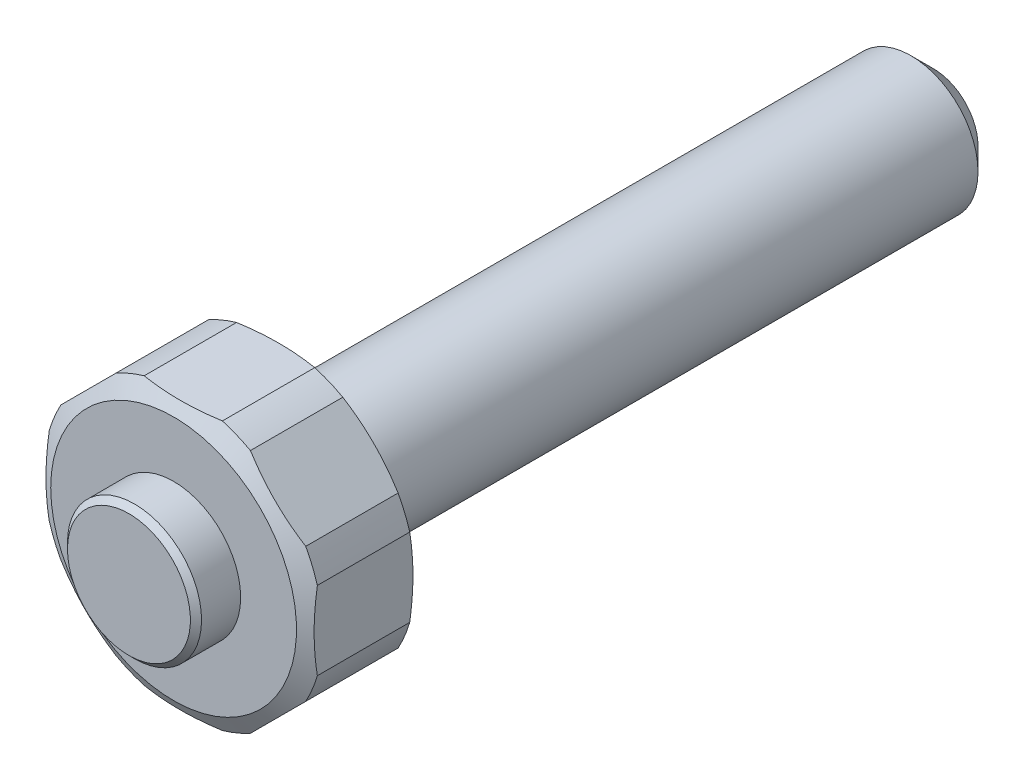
ISO-10303-21;
HEADER;
FILE_DESCRIPTION(('STEP AP214'),'2;1');
FILE_NAME('part.step','',(''),(''),'','','');
FILE_SCHEMA(('AUTOMOTIVE_DESIGN { 1 0 10303 214 1 1 1 1 }'));
ENDSEC;
DATA;
#1=APPLICATION_CONTEXT('core data for automotive mechanical design processes');
#2=APPLICATION_PROTOCOL_DEFINITION('international standard','automotive_design',2000,#1);
#3=PRODUCT_CONTEXT('',#1,'mechanical');
#4=PRODUCT('Part','Part','',(#3));
#5=PRODUCT_RELATED_PRODUCT_CATEGORY('part','',(#4));
#6=PRODUCT_DEFINITION_FORMATION('','',#4);
#7=PRODUCT_DEFINITION_CONTEXT('part definition',#1,'design');
#8=PRODUCT_DEFINITION('design','',#6,#7);
#9=PRODUCT_DEFINITION_SHAPE('','',#8);
#10=(LENGTH_UNIT() NAMED_UNIT(*) SI_UNIT(.MILLI.,.METRE.));
#11=(NAMED_UNIT(*) PLANE_ANGLE_UNIT() SI_UNIT($,.RADIAN.));
#12=(NAMED_UNIT(*) SI_UNIT($,.STERADIAN.) SOLID_ANGLE_UNIT());
#13=UNCERTAINTY_MEASURE_WITH_UNIT(LENGTH_MEASURE(1.E-05),#10,'distance_accuracy_value','');
#14=(GEOMETRIC_REPRESENTATION_CONTEXT(3) GLOBAL_UNCERTAINTY_ASSIGNED_CONTEXT((#13)) GLOBAL_UNIT_ASSIGNED_CONTEXT((#10,
#11,#12)) REPRESENTATION_CONTEXT('',''));
#15=CARTESIAN_POINT('',(0.,0.,0.));
#16=DIRECTION('',(0.,0.,1.));
#17=DIRECTION('',(1.,0.,0.));
#18=AXIS2_PLACEMENT_3D('',#15,#16,#17);
#19=CARTESIAN_POINT('',(6.,0.,0.));
#20=DIRECTION('',(0.,0.,1.));
#21=DIRECTION('',(1.,0.,0.));
#22=AXIS2_PLACEMENT_3D('',#19,#20,#21);
#23=PLANE('',#22);
#24=CARTESIAN_POINT('',(0.,0.,0.));
#25=DIRECTION('',(0.,0.,1.));
#26=DIRECTION('',(1.,0.,0.));
#27=AXIS2_PLACEMENT_3D('',#24,#25,#26);
#28=CIRCLE('',#27,6.);
#29=CARTESIAN_POINT('',(6.,0.,0.));
#30=VERTEX_POINT('',#29);
#31=EDGE_CURVE('E193',#30,#30,#28,.T.);
#32=ORIENTED_EDGE('',*,*,#31,.T.);
#33=EDGE_LOOP('',(#32));
#34=FACE_BOUND('',#33,.T.);
#35=CARTESIAN_POINT('',(0.,0.,0.));
#36=DIRECTION('',(0.,0.,-1.));
#37=DIRECTION('',(-1.,0.,0.));
#38=AXIS2_PLACEMENT_3D('',#35,#36,#37);
#39=CIRCLE('',#38,11.);
#40=CARTESIAN_POINT('',(-11.,0.,0.));
#41=VERTEX_POINT('',#40);
#42=EDGE_CURVE('E449',#41,#41,#39,.T.);
#43=ORIENTED_EDGE('',*,*,#42,.T.);
#44=EDGE_LOOP('',(#43));
#45=FACE_BOUND('',#44,.T.);
#46=ADVANCED_FACE('F14',(#34,#45),#23,.F.);
#47=CARTESIAN_POINT('',(0.,0.,-58.));
#48=DIRECTION('',(0.,0.,1.));
#49=DIRECTION('',(1.,0.,0.));
#50=AXIS2_PLACEMENT_3D('',#47,#48,#49);
#51=PLANE('',#50);
#52=CARTESIAN_POINT('',(0.,0.,-58.));
#53=DIRECTION('',(0.,0.,1.));
#54=DIRECTION('',(1.,0.,0.));
#55=AXIS2_PLACEMENT_3D('',#52,#53,#54);
#56=CIRCLE('',#55,4.);
#57=CARTESIAN_POINT('',(4.,0.,-58.));
#58=VERTEX_POINT('',#57);
#59=EDGE_CURVE('E9',#58,#58,#56,.F.);
#60=ORIENTED_EDGE('',*,*,#59,.T.);
#61=EDGE_LOOP('',(#60));
#62=FACE_BOUND('',#61,.T.);
#63=ADVANCED_FACE('F319',(#62),#51,.F.);
#64=CARTESIAN_POINT('',(0.,0.,22.));
#65=DIRECTION('',(0.,0.,1.));
#66=DIRECTION('',(1.,0.,0.));
#67=AXIS2_PLACEMENT_3D('',#64,#65,#66);
#68=CYLINDRICAL_SURFACE('',#67,6.);
#69=CARTESIAN_POINT('',(0.,0.,-56.));
#70=DIRECTION('',(0.,0.,1.));
#71=DIRECTION('',(1.,0.,0.));
#72=AXIS2_PLACEMENT_3D('',#69,#70,#71);
#73=CIRCLE('',#72,6.);
#74=CARTESIAN_POINT('',(6.,0.,-56.));
#75=VERTEX_POINT('',#74);
#76=EDGE_CURVE('E22',#75,#75,#73,.T.);
#77=ORIENTED_EDGE('',*,*,#76,.T.);
#78=EDGE_LOOP('',(#77));
#79=FACE_BOUND('',#78,.T.);
#80=ORIENTED_EDGE('',*,*,#31,.F.);
#81=EDGE_LOOP('',(#80));
#82=FACE_BOUND('',#81,.T.);
#83=ADVANCED_FACE('F309',(#79,#82),#68,.T.);
#84=CARTESIAN_POINT('',(0.,0.,-58.));
#85=DIRECTION('',(0.,0.,-1.));
#86=DIRECTION('',(-1.,0.,0.));
#87=AXIS2_PLACEMENT_3D('',#84,#85,#86);
#88=CYLINDRICAL_SURFACE('',#87,12.5);
#89=CARTESIAN_POINT('',(0.,0.,9.1339745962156));
#90=DIRECTION('',(0.,0.,-1.));
#91=DIRECTION('',(-1.,0.,0.));
#92=AXIS2_PLACEMENT_3D('',#89,#90,#91);
#93=CIRCLE('',#92,12.5);
#94=CARTESIAN_POINT('',(3.5,-12.,9.1339745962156));
#95=VERTEX_POINT('',#94);
#96=CARTESIAN_POINT('',(6.01040764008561,-10.9601551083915,9.1339745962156));
#97=VERTEX_POINT('',#96);
#98=EDGE_CURVE('E378',#95,#97,#93,.F.);
#99=ORIENTED_EDGE('',*,*,#98,.F.);
#100=DIRECTION('',(0.,0.,-1.));
#101=VECTOR('',#100,1.);
#102=CARTESIAN_POINT('',(3.5,-12.,-58.));
#103=LINE('',#102,#101);
#104=CARTESIAN_POINT('',(3.5,-12.,0.866025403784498));
#105=VERTEX_POINT('',#104);
#106=EDGE_CURVE('E357',#95,#105,#103,.T.);
#107=ORIENTED_EDGE('',*,*,#106,.T.);
#108=CARTESIAN_POINT('',(0.,0.,0.866025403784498));
#109=DIRECTION('',(0.,0.,1.));
#110=DIRECTION('',(1.,0.,0.));
#111=AXIS2_PLACEMENT_3D('',#108,#109,#110);
#112=CIRCLE('',#111,12.5);
#113=CARTESIAN_POINT('',(6.01040764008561,-10.9601551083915,0.866025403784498));
#114=VERTEX_POINT('',#113);
#115=EDGE_CURVE('E443',#114,#105,#112,.F.);
#116=ORIENTED_EDGE('',*,*,#115,.F.);
#117=DIRECTION('',(0.,0.,-1.));
#118=VECTOR('',#117,1.);
#119=CARTESIAN_POINT('',(6.01040764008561,-10.9601551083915,-58.));
#120=LINE('',#119,#118);
#121=EDGE_CURVE('E187',#97,#114,#120,.T.);
#122=ORIENTED_EDGE('',*,*,#121,.F.);
#123=EDGE_LOOP('',(#99,#107,#116,#122));
#124=FACE_BOUND('',#123,.T.);
#125=ADVANCED_FACE('F305',(#124),#88,.T.);
#126=CARTESIAN_POINT('',(12.,-3.5,0.866025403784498));
#127=VERTEX_POINT('',#126);
#128=CARTESIAN_POINT('',(10.9601551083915,-6.01040764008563,0.866025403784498));
#129=VERTEX_POINT('',#128);
#130=EDGE_CURVE('E29',#127,#129,#112,.F.);
#131=ORIENTED_EDGE('',*,*,#130,.F.);
#132=DIRECTION('',(0.,0.,-1.));
#133=VECTOR('',#132,1.);
#134=CARTESIAN_POINT('',(12.,-3.5,-58.));
#135=LINE('',#134,#133);
#136=CARTESIAN_POINT('',(12.,-3.5,9.1339745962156));
#137=VERTEX_POINT('',#136);
#138=EDGE_CURVE('E181',#137,#127,#135,.T.);
#139=ORIENTED_EDGE('',*,*,#138,.F.);
#140=CARTESIAN_POINT('',(10.9601551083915,-6.01040764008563,9.1339745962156));
#141=VERTEX_POINT('',#140);
#142=EDGE_CURVE('E459',#141,#137,#93,.F.);
#143=ORIENTED_EDGE('',*,*,#142,.F.);
#144=DIRECTION('',(0.,0.,-1.));
#145=VECTOR('',#144,1.);
#146=CARTESIAN_POINT('',(10.9601551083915,-6.01040764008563,-58.));
#147=LINE('',#146,#145);
#148=EDGE_CURVE('E184',#129,#141,#147,.F.);
#149=ORIENTED_EDGE('',*,*,#148,.F.);
#150=EDGE_LOOP('',(#131,#139,#143,#149));
#151=FACE_BOUND('',#150,.T.);
#152=ADVANCED_FACE('F308',(#151),#88,.T.);
#153=CARTESIAN_POINT('',(10.9601551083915,6.01040764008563,0.866025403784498));
#154=VERTEX_POINT('',#153);
#155=CARTESIAN_POINT('',(12.,3.5,0.866025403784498));
#156=VERTEX_POINT('',#155);
#157=EDGE_CURVE('E35',#154,#156,#112,.F.);
#158=ORIENTED_EDGE('',*,*,#157,.F.);
#159=DIRECTION('',(0.,0.,-1.));
#160=VECTOR('',#159,1.);
#161=CARTESIAN_POINT('',(10.9601551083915,6.01040764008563,-58.));
#162=LINE('',#161,#160);
#163=CARTESIAN_POINT('',(10.9601551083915,6.01040764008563,9.1339745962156));
#164=VERTEX_POINT('',#163);
#165=EDGE_CURVE('E175',#164,#154,#162,.T.);
#166=ORIENTED_EDGE('',*,*,#165,.F.);
#167=CARTESIAN_POINT('',(12.,3.5,9.1339745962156));
#168=VERTEX_POINT('',#167);
#169=EDGE_CURVE('E428',#168,#164,#93,.F.);
#170=ORIENTED_EDGE('',*,*,#169,.F.);
#171=DIRECTION('',(0.,0.,-1.));
#172=VECTOR('',#171,1.);
#173=CARTESIAN_POINT('',(12.,3.5,-58.));
#174=LINE('',#173,#172);
#175=EDGE_CURVE('E178',#156,#168,#174,.F.);
#176=ORIENTED_EDGE('',*,*,#175,.F.);
#177=EDGE_LOOP('',(#158,#166,#170,#176));
#178=FACE_BOUND('',#177,.T.);
#179=ADVANCED_FACE('F317',(#178),#88,.T.);
#180=CARTESIAN_POINT('',(3.5,12.,0.866025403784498));
#181=VERTEX_POINT('',#180);
#182=CARTESIAN_POINT('',(6.01040764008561,10.9601551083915,0.866025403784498));
#183=VERTEX_POINT('',#182);
#184=EDGE_CURVE('E447',#181,#183,#112,.F.);
#185=ORIENTED_EDGE('',*,*,#184,.F.);
#186=DIRECTION('',(0.,0.,-1.));
#187=VECTOR('',#186,1.);
#188=CARTESIAN_POINT('',(3.5,12.,-58.));
#189=LINE('',#188,#187);
#190=CARTESIAN_POINT('',(3.5,12.,9.1339745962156));
#191=VERTEX_POINT('',#190);
#192=EDGE_CURVE('E169',#191,#181,#189,.T.);
#193=ORIENTED_EDGE('',*,*,#192,.F.);
#194=CARTESIAN_POINT('',(6.01040764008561,10.9601551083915,9.1339745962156));
#195=VERTEX_POINT('',#194);
#196=EDGE_CURVE('E426',#195,#191,#93,.F.);
#197=ORIENTED_EDGE('',*,*,#196,.F.);
#198=DIRECTION('',(0.,0.,-1.));
#199=VECTOR('',#198,1.);
#200=CARTESIAN_POINT('',(6.01040764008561,10.9601551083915,-58.));
#201=LINE('',#200,#199);
#202=EDGE_CURVE('E172',#183,#195,#201,.F.);
#203=ORIENTED_EDGE('',*,*,#202,.F.);
#204=EDGE_LOOP('',(#185,#193,#197,#203));
#205=FACE_BOUND('',#204,.T.);
#206=ADVANCED_FACE('F433',(#205),#88,.T.);
#207=CARTESIAN_POINT('',(-6.0104076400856,10.9601551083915,0.866025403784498));
#208=VERTEX_POINT('',#207);
#209=CARTESIAN_POINT('',(-3.5,12.,0.866025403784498));
#210=VERTEX_POINT('',#209);
#211=EDGE_CURVE('E444',#208,#210,#112,.F.);
#212=ORIENTED_EDGE('',*,*,#211,.F.);
#213=DIRECTION('',(0.,0.,-1.));
#214=VECTOR('',#213,1.);
#215=CARTESIAN_POINT('',(-6.01040764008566,10.9601551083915,-58.));
#216=LINE('',#215,#214);
#217=CARTESIAN_POINT('',(-6.0104076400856,10.9601551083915,9.1339745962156));
#218=VERTEX_POINT('',#217);
#219=EDGE_CURVE('E158',#218,#208,#216,.T.);
#220=ORIENTED_EDGE('',*,*,#219,.F.);
#221=CARTESIAN_POINT('',(-3.5,12.,9.1339745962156));
#222=VERTEX_POINT('',#221);
#223=EDGE_CURVE('E435',#222,#218,#93,.F.);
#224=ORIENTED_EDGE('',*,*,#223,.F.);
#225=DIRECTION('',(0.,0.,-1.));
#226=VECTOR('',#225,1.);
#227=CARTESIAN_POINT('',(-3.5,12.,-58.));
#228=LINE('',#227,#226);
#229=EDGE_CURVE('E166',#210,#222,#228,.F.);
#230=ORIENTED_EDGE('',*,*,#229,.F.);
#231=EDGE_LOOP('',(#212,#220,#224,#230));
#232=FACE_BOUND('',#231,.T.);
#233=ADVANCED_FACE('F468',(#232),#88,.T.);
#234=DIRECTION('',(0.,0.,-1.));
#235=VECTOR('',#234,1.);
#236=CARTESIAN_POINT('',(-12.,-3.5,-58.));
#237=LINE('',#236,#235);
#238=CARTESIAN_POINT('',(-12.,-3.5,9.1339745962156));
#239=VERTEX_POINT('',#238);
#240=CARTESIAN_POINT('',(-12.,-3.5,0.866025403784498));
#241=VERTEX_POINT('',#240);
#242=EDGE_CURVE('E145',#239,#241,#237,.T.);
#243=ORIENTED_EDGE('',*,*,#242,.T.);
#244=CARTESIAN_POINT('',(-10.9601551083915,-6.01040764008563,0.866025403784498));
#245=VERTEX_POINT('',#244);
#246=EDGE_CURVE('E441',#245,#241,#112,.F.);
#247=ORIENTED_EDGE('',*,*,#246,.F.);
#248=DIRECTION('',(0.,0.,-1.));
#249=VECTOR('',#248,1.);
#250=CARTESIAN_POINT('',(-10.9601551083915,-6.01040764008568,-58.));
#251=LINE('',#250,#249);
#252=CARTESIAN_POINT('',(-10.9601551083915,-6.01040764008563,9.1339745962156));
#253=VERTEX_POINT('',#252);
#254=EDGE_CURVE('E148',#245,#253,#251,.F.);
#255=ORIENTED_EDGE('',*,*,#254,.T.);
#256=EDGE_CURVE('E131',#239,#253,#93,.F.);
#257=ORIENTED_EDGE('',*,*,#256,.F.);
#258=EDGE_LOOP('',(#243,#247,#255,#257));
#259=FACE_BOUND('',#258,.T.);
#260=ADVANCED_FACE('F143',(#259),#88,.T.);
#261=CARTESIAN_POINT('',(-12.,3.5,0.866025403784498));
#262=VERTEX_POINT('',#261);
#263=CARTESIAN_POINT('',(-10.9601551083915,6.0104076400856,0.866025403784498));
#264=VERTEX_POINT('',#263);
#265=EDGE_CURVE('E442',#262,#264,#112,.F.);
#266=ORIENTED_EDGE('',*,*,#265,.F.);
#267=DIRECTION('',(0.,0.,-1.));
#268=VECTOR('',#267,1.);
#269=CARTESIAN_POINT('',(-12.,3.5,-58.));
#270=LINE('',#269,#268);
#271=CARTESIAN_POINT('',(-12.,3.5,9.1339745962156));
#272=VERTEX_POINT('',#271);
#273=EDGE_CURVE('E155',#262,#272,#270,.F.);
#274=ORIENTED_EDGE('',*,*,#273,.T.);
#275=CARTESIAN_POINT('',(-10.9601551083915,6.0104076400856,9.1339745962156));
#276=VERTEX_POINT('',#275);
#277=EDGE_CURVE('E134',#276,#272,#93,.F.);
#278=ORIENTED_EDGE('',*,*,#277,.F.);
#279=DIRECTION('',(0.,0.,-1.));
#280=VECTOR('',#279,1.);
#281=CARTESIAN_POINT('',(-10.9601551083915,6.01040764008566,-58.));
#282=LINE('',#281,#280);
#283=EDGE_CURVE('E154',#264,#276,#282,.F.);
#284=ORIENTED_EDGE('',*,*,#283,.F.);
#285=EDGE_LOOP('',(#266,#274,#278,#284));
#286=FACE_BOUND('',#285,.T.);
#287=ADVANCED_FACE('F324',(#286),#88,.T.);
#288=DIRECTION('',(0.,0.,-1.));
#289=VECTOR('',#288,1.);
#290=CARTESIAN_POINT('',(-6.01040764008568,-10.9601551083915,-58.));
#291=LINE('',#290,#289);
#292=CARTESIAN_POINT('',(-6.01040764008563,-10.9601551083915,9.1339745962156));
#293=VERTEX_POINT('',#292);
#294=CARTESIAN_POINT('',(-6.01040764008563,-10.9601551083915,0.866025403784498));
#295=VERTEX_POINT('',#294);
#296=EDGE_CURVE('E160',#293,#295,#291,.T.);
#297=ORIENTED_EDGE('',*,*,#296,.T.);
#298=CARTESIAN_POINT('',(-3.5,-12.,0.866025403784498));
#299=VERTEX_POINT('',#298);
#300=EDGE_CURVE('E374',#299,#295,#112,.F.);
#301=ORIENTED_EDGE('',*,*,#300,.F.);
#302=DIRECTION('',(0.,0.,-1.));
#303=VECTOR('',#302,1.);
#304=CARTESIAN_POINT('',(-3.5,-12.,-58.));
#305=LINE('',#304,#303);
#306=CARTESIAN_POINT('',(-3.5,-12.,9.1339745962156));
#307=VERTEX_POINT('',#306);
#308=EDGE_CURVE('E205',#299,#307,#305,.F.);
#309=ORIENTED_EDGE('',*,*,#308,.T.);
#310=EDGE_CURVE('E150',#293,#307,#93,.F.);
#311=ORIENTED_EDGE('',*,*,#310,.F.);
#312=EDGE_LOOP('',(#297,#301,#309,#311));
#313=FACE_BOUND('',#312,.T.);
#314=ADVANCED_FACE('F215',(#313),#88,.T.);
#315=CARTESIAN_POINT('',(0.,0.,2.5495315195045));
#316=DIRECTION('',(0.,0.,1.));
#317=DIRECTION('',(1.,0.,0.));
#318=AXIS2_PLACEMENT_3D('',#315,#316,#317);
#319=CONICAL_SURFACE('',#318,15.4159181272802,1.0471975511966);
#320=CARTESIAN_POINT('',(10.9610297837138,-6.00953296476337,0.8662254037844));
#321=CARTESIAN_POINT('',(10.7557968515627,-6.21476589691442,0.819258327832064));
#322=CARTESIAN_POINT('',(10.5499383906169,-6.42062435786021,0.77758722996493));
#323=CARTESIAN_POINT('',(10.137202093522,-6.83336065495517,0.70550975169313));
#324=CARTESIAN_POINT('',(9.93032407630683,-7.04023867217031,0.67510545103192));
#325=CARTESIAN_POINT('',(9.51725429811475,-7.45330845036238,0.62641694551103));
#326=CARTESIAN_POINT('',(9.31106732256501,-7.65949542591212,0.608052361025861));
#327=CARTESIAN_POINT('',(8.89834733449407,-8.07221541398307,0.583519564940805));
#328=CARTESIAN_POINT('',(8.69181435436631,-8.27874839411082,0.577350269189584));
#329=CARTESIAN_POINT('',(8.2787483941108,-8.69181435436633,0.577350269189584));
#330=CARTESIAN_POINT('',(8.07221541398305,-8.89834733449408,0.583519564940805));
#331=CARTESIAN_POINT('',(7.65949542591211,-9.31106732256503,0.608052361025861));
#332=CARTESIAN_POINT('',(7.45330845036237,-9.51725429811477,0.62641694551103));
#333=CARTESIAN_POINT('',(7.04023867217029,-9.93032407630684,0.67510545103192));
#334=CARTESIAN_POINT('',(6.83336065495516,-10.137202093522,0.705509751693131));
#335=CARTESIAN_POINT('',(6.42062435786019,-10.5499383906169,0.777587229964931));
#336=CARTESIAN_POINT('',(6.21476589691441,-10.7557968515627,0.819258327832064));
#337=CARTESIAN_POINT('',(6.00953296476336,-10.9610297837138,0.8662254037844));
#338=B_SPLINE_CURVE_WITH_KNOTS('',3,(#320,#321,#322,#323,#324,#325,#326,#327,#328,#329,#330,
#331,#332,#333,#334,#335,#336,#337),.UNSPECIFIED.,.F.,.F.,(4,2,2,2,2,2,2,2,4),(0.,
0.88204821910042,1.76425917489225,2.64051865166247,3.51670022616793,4.39288180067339,
5.2691412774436,6.15135223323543,7.03340045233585),.UNSPECIFIED.);
#339=EDGE_CURVE('E267',#129,#114,#338,.T.);
#340=ORIENTED_EDGE('',*,*,#339,.T.);
#341=ORIENTED_EDGE('',*,*,#115,.T.);
#342=CARTESIAN_POINT('',(-14.9188294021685,-12.,4.7031277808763));
#343=CARTESIAN_POINT('',(-14.6919138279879,-12.,4.60104600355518));
#344=CARTESIAN_POINT('',(-14.464658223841,-12.,4.49972066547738));
#345=CARTESIAN_POINT('',(-14.0094029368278,-12.,4.29874518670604));
#346=CARTESIAN_POINT('',(-13.7814032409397,-12.,4.19909507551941));
#347=CARTESIAN_POINT('',(-13.0961002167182,-12.,3.90286156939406));
#348=CARTESIAN_POINT('',(-12.6375959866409,-12.,3.70904152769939));
#349=CARTESIAN_POINT('',(-11.714140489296,-12.,3.32928856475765));
#350=CARTESIAN_POINT('',(-11.2491671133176,-12.,3.14340924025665));
#351=CARTESIAN_POINT('',(-10.3148928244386,-12.,2.78289851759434));
#352=CARTESIAN_POINT('',(-9.84559219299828,-12.,2.60826639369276));
#353=CARTESIAN_POINT('',(-8.90705094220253,-12.,2.27469533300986));
#354=CARTESIAN_POINT('',(-8.43786305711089,-12.,2.115608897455));
#355=CARTESIAN_POINT('',(-7.49403784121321,-12.,1.81423618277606));
#356=CARTESIAN_POINT('',(-7.01940010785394,-12.,1.67195115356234));
#357=CARTESIAN_POINT('',(-6.06542424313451,-12.,1.40832238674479));
#358=CARTESIAN_POINT('',(-5.58609883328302,-12.,1.28693301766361));
#359=CARTESIAN_POINT('',(-4.6218358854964,-12.,1.06904936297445));
#360=CARTESIAN_POINT('',(-4.1368997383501,-12.,0.97254904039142));
#361=CARTESIAN_POINT('',(-3.36893010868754,-12.,0.843532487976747));
#362=CARTESIAN_POINT('',(-3.08752263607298,-12.,0.801239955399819));
#363=CARTESIAN_POINT('',(-2.52334358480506,-12.,0.727090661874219));
#364=CARTESIAN_POINT('',(-2.24057211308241,-12.,0.695233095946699));
#365=CARTESIAN_POINT('',(-1.6739517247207,-12.,0.642570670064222));
#366=CARTESIAN_POINT('',(-1.39010264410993,-12.,0.621767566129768));
#367=CARTESIAN_POINT('',(-0.821788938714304,-12.,0.591655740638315));
#368=CARTESIAN_POINT('',(-0.537324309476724,-12.,0.582347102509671));
#369=CARTESIAN_POINT('',(0.0320250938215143,-12.,0.575424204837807));
#370=CARTESIAN_POINT('',(0.316910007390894,-12.,0.577821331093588));
#371=CARTESIAN_POINT('',(0.88633713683,-12.,0.594282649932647));
#372=CARTESIAN_POINT('',(1.17087935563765,-12.,0.608346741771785));
#373=CARTESIAN_POINT('',(1.73908078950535,-12.,0.647834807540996));
#374=CARTESIAN_POINT('',(2.02274025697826,-12.,0.673255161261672));
#375=CARTESIAN_POINT('',(2.58888865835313,-12.,0.734930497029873));
#376=CARTESIAN_POINT('',(2.87137747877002,-12.,0.771186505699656));
#377=CARTESIAN_POINT('',(3.7468065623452,-12.,0.899648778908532));
#378=CARTESIAN_POINT('',(4.33722942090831,-12.,1.00936119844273));
#379=CARTESIAN_POINT('',(5.5098985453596,-12.,1.26631503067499));
#380=CARTESIAN_POINT('',(6.09214074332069,-12.,1.4135744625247));
#381=CARTESIAN_POINT('',(7.25041645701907,-12.,1.73846605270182));
#382=CARTESIAN_POINT('',(7.82641718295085,-12.,1.91621366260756));
#383=CARTESIAN_POINT('',(8.97053682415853,-12.,2.29497159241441));
#384=CARTESIAN_POINT('',(9.53865683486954,-12.,2.49597864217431));
#385=CARTESIAN_POINT('',(10.6748965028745,-12.,2.91849340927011));
#386=CARTESIAN_POINT('',(11.2429352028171,-12.,3.14021720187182));
#387=CARTESIAN_POINT('',(12.3732525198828,-12.,3.59793560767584));
#388=CARTESIAN_POINT('',(12.9355306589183,-12.,3.83393139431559));
#389=CARTESIAN_POINT('',(14.0498267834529,-12.,4.3146984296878));
#390=CARTESIAN_POINT('',(14.6018913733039,-12.,4.55936206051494));
#391=CARTESIAN_POINT('',(15.4269629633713,-12.,4.93279527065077));
#392=CARTESIAN_POINT('',(15.7014431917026,-12.,5.05832737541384));
#393=CARTESIAN_POINT('',(16.2495039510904,-12.,5.31132718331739));
#394=CARTESIAN_POINT('',(16.5230844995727,-12.,5.43879484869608));
#395=CARTESIAN_POINT('',(16.7962614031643,-12.,5.5671222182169));
#396=B_SPLINE_CURVE_WITH_KNOTS('',3,(#342,#343,#344,#345,#346,#347,#348,#349,#350,#351,#352,
#353,#354,#355,#356,#357,#358,#359,#360,#361,#362,#363,#364,#365,#366,#367,#368,#369,#370,#371,
#372,#373,#374,#375,#376,#377,#378,#379,#380,#381,#382,#383,#384,#385,#386,#387,#388,#389,#390,
#391,#392,#393,#394,#395),.UNSPECIFIED.,.F.,.F.,(4,2,2,2,2,2,2,2,2,2,2,2,2,2,2,2,2,2,2,2,2,2,2,
2,2,2,4),(0.,0.746457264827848,1.49292766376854,2.98620758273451,4.48834418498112,
5.99038376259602,7.47640484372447,8.96253640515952,10.4453802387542,11.9278640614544,
12.7814006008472,13.6348712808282,14.4884774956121,15.3420899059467,16.1965327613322,
17.0509682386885,17.905131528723,18.7593757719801,20.5592996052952,22.3600888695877,
24.1678542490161,25.9753657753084,27.8044536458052,29.633692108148,31.4451470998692,
32.3506131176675,33.2560614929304),.UNSPECIFIED.);
#397=EDGE_CURVE('E196',#299,#105,#396,.T.);
#398=ORIENTED_EDGE('',*,*,#397,.F.);
#399=ORIENTED_EDGE('',*,*,#300,.T.);
#400=CARTESIAN_POINT('',(-10.9610297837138,-6.00953296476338,0.8662254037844));
#401=CARTESIAN_POINT('',(-10.7557968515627,-6.21476589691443,0.819258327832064));
#402=CARTESIAN_POINT('',(-10.5499383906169,-6.42062435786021,0.77758722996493));
#403=CARTESIAN_POINT('',(-10.137202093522,-6.83336065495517,0.70550975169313));
#404=CARTESIAN_POINT('',(-9.93032407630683,-7.04023867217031,0.67510545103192));
#405=CARTESIAN_POINT('',(-9.51725429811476,-7.45330845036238,0.626416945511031));
#406=CARTESIAN_POINT('',(-9.31106732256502,-7.65949542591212,0.608052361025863));
#407=CARTESIAN_POINT('',(-8.89834733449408,-8.07221541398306,0.583519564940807));
#408=CARTESIAN_POINT('',(-8.69181435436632,-8.27874839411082,0.577350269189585));
#409=CARTESIAN_POINT('',(-8.27874839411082,-8.69181435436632,0.577350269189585));
#410=CARTESIAN_POINT('',(-8.07221541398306,-8.89834733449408,0.583519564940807));
#411=CARTESIAN_POINT('',(-7.65949542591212,-9.31106732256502,0.608052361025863));
#412=CARTESIAN_POINT('',(-7.45330845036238,-9.51725429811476,0.626416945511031));
#413=CARTESIAN_POINT('',(-7.04023867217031,-9.93032407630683,0.67510545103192));
#414=CARTESIAN_POINT('',(-6.83336065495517,-10.137202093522,0.705509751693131));
#415=CARTESIAN_POINT('',(-6.42062435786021,-10.5499383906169,0.777587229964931));
#416=CARTESIAN_POINT('',(-6.21476589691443,-10.7557968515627,0.819258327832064));
#417=CARTESIAN_POINT('',(-6.00953296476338,-10.9610297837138,0.8662254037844));
#418=B_SPLINE_CURVE_WITH_KNOTS('',3,(#400,#401,#402,#403,#404,#405,#406,#407,#408,#409,#410,
#411,#412,#413,#414,#415,#416,#417),.UNSPECIFIED.,.F.,.F.,(4,2,2,2,2,2,2,2,4),(0.,
0.882048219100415,1.76425917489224,2.64051865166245,3.51670022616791,4.39288180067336,
5.26914127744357,6.1513522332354,7.03340045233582),.UNSPECIFIED.);
#419=EDGE_CURVE('E224',#245,#295,#418,.T.);
#420=ORIENTED_EDGE('',*,*,#419,.F.);
#421=ORIENTED_EDGE('',*,*,#246,.T.);
#422=CARTESIAN_POINT('',(-12.,-14.9188294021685,4.7031277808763));
#423=CARTESIAN_POINT('',(-12.,-14.6919138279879,4.60104600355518));
#424=CARTESIAN_POINT('',(-12.,-14.464658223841,4.49972066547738));
#425=CARTESIAN_POINT('',(-12.,-14.0094029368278,4.29874518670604));
#426=CARTESIAN_POINT('',(-12.,-13.7814032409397,4.19909507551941));
#427=CARTESIAN_POINT('',(-12.,-13.0961002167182,3.90286156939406));
#428=CARTESIAN_POINT('',(-12.,-12.6375959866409,3.70904152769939));
#429=CARTESIAN_POINT('',(-12.,-11.714140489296,3.32928856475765));
#430=CARTESIAN_POINT('',(-12.,-11.2491671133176,3.14340924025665));
#431=CARTESIAN_POINT('',(-12.,-10.3148928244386,2.78289851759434));
#432=CARTESIAN_POINT('',(-12.,-9.84559219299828,2.60826639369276));
#433=CARTESIAN_POINT('',(-12.,-8.90705094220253,2.27469533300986));
#434=CARTESIAN_POINT('',(-12.,-8.43786305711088,2.11560889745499));
#435=CARTESIAN_POINT('',(-12.,-7.49403784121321,1.81423618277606));
#436=CARTESIAN_POINT('',(-12.,-7.01940010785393,1.67195115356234));
#437=CARTESIAN_POINT('',(-12.,-6.06542424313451,1.40832238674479));
#438=CARTESIAN_POINT('',(-12.,-5.58609883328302,1.2869330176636));
#439=CARTESIAN_POINT('',(-12.,-4.6218358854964,1.06904936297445));
#440=CARTESIAN_POINT('',(-12.,-4.1368997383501,0.97254904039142));
#441=CARTESIAN_POINT('',(-12.,-3.36893010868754,0.843532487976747));
#442=CARTESIAN_POINT('',(-12.,-3.08752263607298,0.801239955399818));
#443=CARTESIAN_POINT('',(-12.,-2.52334358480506,0.727090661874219));
#444=CARTESIAN_POINT('',(-12.,-2.24057211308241,0.695233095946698));
#445=CARTESIAN_POINT('',(-12.,-1.6739517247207,0.642570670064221));
#446=CARTESIAN_POINT('',(-12.,-1.39010264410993,0.621767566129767));
#447=CARTESIAN_POINT('',(-12.,-0.821788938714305,0.591655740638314));
#448=CARTESIAN_POINT('',(-12.,-0.537324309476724,0.582347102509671));
#449=CARTESIAN_POINT('',(-12.,0.0320250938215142,0.575424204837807));
#450=CARTESIAN_POINT('',(-12.,0.316910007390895,0.577821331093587));
#451=CARTESIAN_POINT('',(-12.,0.886337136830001,0.594282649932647));
#452=CARTESIAN_POINT('',(-12.,1.17087935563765,0.608346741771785));
#453=CARTESIAN_POINT('',(-12.,1.73908078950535,0.647834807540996));
#454=CARTESIAN_POINT('',(-12.,2.02274025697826,0.673255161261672));
#455=CARTESIAN_POINT('',(-12.,2.58888865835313,0.734930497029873));
#456=CARTESIAN_POINT('',(-12.,2.87137747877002,0.771186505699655));
#457=CARTESIAN_POINT('',(-12.,3.7468065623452,0.899648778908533));
#458=CARTESIAN_POINT('',(-12.,4.33722942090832,1.00936119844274));
#459=CARTESIAN_POINT('',(-12.,5.50989854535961,1.26631503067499));
#460=CARTESIAN_POINT('',(-12.,6.0921407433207,1.41357446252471));
#461=CARTESIAN_POINT('',(-12.,7.25041645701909,1.73846605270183));
#462=CARTESIAN_POINT('',(-12.,7.82641718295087,1.91621366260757));
#463=CARTESIAN_POINT('',(-12.,8.97053682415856,2.29497159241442));
#464=CARTESIAN_POINT('',(-12.,9.53865683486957,2.49597864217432));
#465=CARTESIAN_POINT('',(-12.,10.6748965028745,2.91849340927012));
#466=CARTESIAN_POINT('',(-12.,11.2429352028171,3.14021720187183));
#467=CARTESIAN_POINT('',(-12.,12.3732525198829,3.59793560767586));
#468=CARTESIAN_POINT('',(-12.,12.9355306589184,3.8339313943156));
#469=CARTESIAN_POINT('',(-12.,14.0498267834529,4.31469842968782));
#470=CARTESIAN_POINT('',(-12.,14.6018913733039,4.55936206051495));
#471=CARTESIAN_POINT('',(-12.,15.4269629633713,4.93279527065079));
#472=CARTESIAN_POINT('',(-12.,15.7014431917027,5.05832737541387));
#473=CARTESIAN_POINT('',(-12.,16.2495039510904,5.31132718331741));
#474=CARTESIAN_POINT('',(-12.,16.5230844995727,5.4387948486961));
#475=CARTESIAN_POINT('',(-12.,16.7962614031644,5.5671222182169));
#476=B_SPLINE_CURVE_WITH_KNOTS('',3,(#422,#423,#424,#425,#426,#427,#428,#429,#430,#431,#432,
#433,#434,#435,#436,#437,#438,#439,#440,#441,#442,#443,#444,#445,#446,#447,#448,#449,#450,#451,
#452,#453,#454,#455,#456,#457,#458,#459,#460,#461,#462,#463,#464,#465,#466,#467,#468,#469,#470,
#471,#472,#473,#474,#475),.UNSPECIFIED.,.F.,.F.,(4,2,2,2,2,2,2,2,2,2,2,2,2,2,2,2,2,2,2,2,2,2,2,
2,2,2,4),(0.,0.746457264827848,1.49292766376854,2.98620758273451,4.48834418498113,
5.99038376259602,7.47640484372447,8.96253640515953,10.4453802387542,11.9278640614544,
12.7814006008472,13.6348712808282,14.4884774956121,15.3420899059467,16.1965327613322,
17.0509682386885,17.905131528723,18.7593757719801,20.5592996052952,22.3600888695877,
24.1678542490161,25.9753657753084,27.8044536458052,29.633692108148,31.4451470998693,
32.3506131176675,33.2560614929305),.UNSPECIFIED.);
#477=EDGE_CURVE('E153',#262,#241,#476,.F.);
#478=ORIENTED_EDGE('',*,*,#477,.F.);
#479=ORIENTED_EDGE('',*,*,#265,.T.);
#480=CARTESIAN_POINT('',(-10.9610297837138,6.00953296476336,0.8662254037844));
#481=CARTESIAN_POINT('',(-10.7557968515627,6.21476589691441,0.819258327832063));
#482=CARTESIAN_POINT('',(-10.5499383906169,6.42062435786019,0.77758722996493));
#483=CARTESIAN_POINT('',(-10.137202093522,6.83336065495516,0.705509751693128));
#484=CARTESIAN_POINT('',(-9.93032407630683,7.0402386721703,0.675105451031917));
#485=CARTESIAN_POINT('',(-9.51725429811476,7.45330845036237,0.626416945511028));
#486=CARTESIAN_POINT('',(-9.31106732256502,7.65949542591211,0.60805236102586));
#487=CARTESIAN_POINT('',(-8.89834733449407,8.07221541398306,0.583519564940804));
#488=CARTESIAN_POINT('',(-8.69181435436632,8.27874839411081,0.577350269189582));
#489=CARTESIAN_POINT('',(-8.27874839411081,8.69181435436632,0.577350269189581));
#490=CARTESIAN_POINT('',(-8.07221541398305,8.89834733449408,0.583519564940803));
#491=CARTESIAN_POINT('',(-7.65949542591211,9.31106732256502,0.608052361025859));
#492=CARTESIAN_POINT('',(-7.45330845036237,9.51725429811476,0.626416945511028));
#493=CARTESIAN_POINT('',(-7.04023867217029,9.93032407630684,0.675105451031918));
#494=CARTESIAN_POINT('',(-6.83336065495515,10.137202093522,0.705509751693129));
#495=CARTESIAN_POINT('',(-6.42062435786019,10.5499383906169,0.77758722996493));
#496=CARTESIAN_POINT('',(-6.2147658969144,10.7557968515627,0.819258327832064));
#497=CARTESIAN_POINT('',(-6.00953296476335,10.9610297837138,0.8662254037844));
#498=B_SPLINE_CURVE_WITH_KNOTS('',3,(#480,#481,#482,#483,#484,#485,#486,#487,#488,#489,#490,
#491,#492,#493,#494,#495,#496,#497),.UNSPECIFIED.,.F.,.F.,(4,2,2,2,2,2,2,2,4),(0.,
0.882048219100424,1.76425917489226,2.64051865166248,3.51670022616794,4.3928818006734,
5.26914127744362,6.15135223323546,7.03340045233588),.UNSPECIFIED.);
#499=EDGE_CURVE('E239',#264,#208,#498,.T.);
#500=ORIENTED_EDGE('',*,*,#499,.T.);
#501=ORIENTED_EDGE('',*,*,#211,.T.);
#502=CARTESIAN_POINT('',(-14.9188294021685,12.,4.70312778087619));
#503=CARTESIAN_POINT('',(-14.6919138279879,12.,4.60104600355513));
#504=CARTESIAN_POINT('',(-14.4646582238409,12.,4.49972066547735));
#505=CARTESIAN_POINT('',(-14.0094029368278,12.,4.29874518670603));
#506=CARTESIAN_POINT('',(-13.7814032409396,12.,4.1990950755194));
#507=CARTESIAN_POINT('',(-13.0961002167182,12.,3.90286156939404));
#508=CARTESIAN_POINT('',(-12.6375959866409,12.,3.70904152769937));
#509=CARTESIAN_POINT('',(-11.714140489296,12.,3.32928856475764));
#510=CARTESIAN_POINT('',(-11.2491671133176,12.,3.14340924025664));
#511=CARTESIAN_POINT('',(-10.3148928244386,12.,2.78289851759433));
#512=CARTESIAN_POINT('',(-9.84559219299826,12.,2.60826639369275));
#513=CARTESIAN_POINT('',(-8.90705094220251,12.,2.27469533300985));
#514=CARTESIAN_POINT('',(-8.43786305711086,12.,2.11560889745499));
#515=CARTESIAN_POINT('',(-7.49403784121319,12.,1.81423618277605));
#516=CARTESIAN_POINT('',(-7.01940010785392,12.,1.67195115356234));
#517=CARTESIAN_POINT('',(-6.06542424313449,12.,1.40832238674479));
#518=CARTESIAN_POINT('',(-5.586098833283,12.,1.2869330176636));
#519=CARTESIAN_POINT('',(-4.62183588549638,12.,1.06904936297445));
#520=CARTESIAN_POINT('',(-4.13689973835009,12.,0.972549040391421));
#521=CARTESIAN_POINT('',(-3.36893010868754,12.,0.843532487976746));
#522=CARTESIAN_POINT('',(-3.08752263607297,12.,0.801239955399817));
#523=CARTESIAN_POINT('',(-2.52334358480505,12.,0.727090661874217));
#524=CARTESIAN_POINT('',(-2.2405721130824,12.,0.695233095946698));
#525=CARTESIAN_POINT('',(-1.67395172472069,12.,0.642570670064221));
#526=CARTESIAN_POINT('',(-1.39010264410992,12.,0.621767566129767));
#527=CARTESIAN_POINT('',(-0.821788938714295,12.,0.591655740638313));
#528=CARTESIAN_POINT('',(-0.537324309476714,12.,0.582347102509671));
#529=CARTESIAN_POINT('',(0.0320250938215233,12.,0.575424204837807));
#530=CARTESIAN_POINT('',(0.316910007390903,12.,0.577821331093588));
#531=CARTESIAN_POINT('',(0.886337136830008,12.,0.594282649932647));
#532=CARTESIAN_POINT('',(1.17087935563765,12.,0.608346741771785));
#533=CARTESIAN_POINT('',(1.73908078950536,12.,0.647834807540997));
#534=CARTESIAN_POINT('',(2.02274025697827,12.,0.673255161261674));
#535=CARTESIAN_POINT('',(2.58888865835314,12.,0.734930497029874));
#536=CARTESIAN_POINT('',(2.87137747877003,12.,0.771186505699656));
#537=CARTESIAN_POINT('',(3.74680656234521,12.,0.899648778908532));
#538=CARTESIAN_POINT('',(4.33722942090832,12.,1.00936119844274));
#539=CARTESIAN_POINT('',(5.50989854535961,12.,1.26631503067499));
#540=CARTESIAN_POINT('',(6.09214074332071,12.,1.41357446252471));
#541=CARTESIAN_POINT('',(7.25041645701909,12.,1.73846605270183));
#542=CARTESIAN_POINT('',(7.82641718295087,12.,1.91621366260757));
#543=CARTESIAN_POINT('',(8.97053682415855,12.,2.29497159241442));
#544=CARTESIAN_POINT('',(9.53865683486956,12.,2.49597864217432));
#545=CARTESIAN_POINT('',(10.6748965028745,12.,2.91849340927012));
#546=CARTESIAN_POINT('',(11.2429352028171,12.,3.14021720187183));
#547=CARTESIAN_POINT('',(12.3732525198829,12.,3.59793560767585));
#548=CARTESIAN_POINT('',(12.9355306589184,12.,3.8339313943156));
#549=CARTESIAN_POINT('',(14.0498267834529,12.,4.31469842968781));
#550=CARTESIAN_POINT('',(14.6018913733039,12.,4.55936206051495));
#551=CARTESIAN_POINT('',(15.4269629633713,12.,4.93279527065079));
#552=CARTESIAN_POINT('',(15.7014431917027,12.,5.05832737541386));
#553=CARTESIAN_POINT('',(16.2495039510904,12.,5.31132718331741));
#554=CARTESIAN_POINT('',(16.5230844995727,12.,5.4387948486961));
#555=CARTESIAN_POINT('',(16.7962614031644,12.,5.5671222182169));
#556=B_SPLINE_CURVE_WITH_KNOTS('',3,(#502,#503,#504,#505,#506,#507,#508,#509,#510,#511,#512,
#513,#514,#515,#516,#517,#518,#519,#520,#521,#522,#523,#524,#525,#526,#527,#528,#529,#530,#531,
#532,#533,#534,#535,#536,#537,#538,#539,#540,#541,#542,#543,#544,#545,#546,#547,#548,#549,#550,
#551,#552,#553,#554,#555),.UNSPECIFIED.,.F.,.F.,(4,2,2,2,2,2,2,2,2,2,2,2,2,2,2,2,2,2,2,2,2,2,2,
2,2,2,4),(0.,0.746457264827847,1.49292766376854,2.98620758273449,4.48834418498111,
5.990383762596,7.47640484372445,8.9625364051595,10.4453802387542,11.9278640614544,
12.7814006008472,13.6348712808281,14.4884774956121,15.3420899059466,16.1965327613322,
17.0509682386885,17.9051315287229,18.75937577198,20.5592996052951,22.3600888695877,
24.1678542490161,25.9753657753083,27.8044536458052,29.633692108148,31.4451470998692,
32.3506131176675,33.2560614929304),.UNSPECIFIED.);
#557=EDGE_CURVE('E247',#210,#181,#556,.T.);
#558=ORIENTED_EDGE('',*,*,#557,.T.);
#559=ORIENTED_EDGE('',*,*,#184,.T.);
#560=CARTESIAN_POINT('',(6.00953296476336,10.9610297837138,0.8662254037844));
#561=CARTESIAN_POINT('',(6.21476589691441,10.7557968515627,0.819258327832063));
#562=CARTESIAN_POINT('',(6.42062435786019,10.5499383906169,0.77758722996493));
#563=CARTESIAN_POINT('',(6.83336065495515,10.137202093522,0.70550975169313));
#564=CARTESIAN_POINT('',(7.04023867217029,9.93032407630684,0.67510545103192));
#565=CARTESIAN_POINT('',(7.45330845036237,9.51725429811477,0.62641694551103));
#566=CARTESIAN_POINT('',(7.65949542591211,9.31106732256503,0.608052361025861));
#567=CARTESIAN_POINT('',(8.07221541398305,8.89834733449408,0.583519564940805));
#568=CARTESIAN_POINT('',(8.2787483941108,8.69181435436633,0.577350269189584));
#569=CARTESIAN_POINT('',(8.69181435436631,8.27874839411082,0.577350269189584));
#570=CARTESIAN_POINT('',(8.89834733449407,8.07221541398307,0.583519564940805));
#571=CARTESIAN_POINT('',(9.31106732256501,7.65949542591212,0.608052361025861));
#572=CARTESIAN_POINT('',(9.51725429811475,7.45330845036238,0.62641694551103));
#573=CARTESIAN_POINT('',(9.93032407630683,7.04023867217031,0.675105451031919));
#574=CARTESIAN_POINT('',(10.137202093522,6.83336065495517,0.70550975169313));
#575=CARTESIAN_POINT('',(10.5499383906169,6.42062435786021,0.77758722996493));
#576=CARTESIAN_POINT('',(10.7557968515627,6.21476589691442,0.819258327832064));
#577=CARTESIAN_POINT('',(10.9610297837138,6.00953296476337,0.8662254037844));
#578=B_SPLINE_CURVE_WITH_KNOTS('',3,(#560,#561,#562,#563,#564,#565,#566,#567,#568,#569,#570,
#571,#572,#573,#574,#575,#576,#577),.UNSPECIFIED.,.F.,.F.,(4,2,2,2,2,2,2,2,4),(0.,
0.88204821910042,1.76425917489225,2.64051865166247,3.51670022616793,4.39288180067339,
5.2691412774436,6.15135223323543,7.03340045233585),.UNSPECIFIED.);
#579=EDGE_CURVE('E254',#183,#154,#578,.T.);
#580=ORIENTED_EDGE('',*,*,#579,.T.);
#581=ORIENTED_EDGE('',*,*,#157,.T.);
#582=CARTESIAN_POINT('',(12.,-14.9188294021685,4.7031277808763));
#583=CARTESIAN_POINT('',(12.,-14.6919138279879,4.60104600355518));
#584=CARTESIAN_POINT('',(12.,-14.464658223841,4.49972066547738));
#585=CARTESIAN_POINT('',(12.,-14.0094029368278,4.29874518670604));
#586=CARTESIAN_POINT('',(12.,-13.7814032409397,4.19909507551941));
#587=CARTESIAN_POINT('',(12.,-13.0961002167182,3.90286156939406));
#588=CARTESIAN_POINT('',(12.,-12.6375959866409,3.70904152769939));
#589=CARTESIAN_POINT('',(12.,-11.714140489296,3.32928856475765));
#590=CARTESIAN_POINT('',(12.,-11.2491671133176,3.14340924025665));
#591=CARTESIAN_POINT('',(12.,-10.3148928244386,2.78289851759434));
#592=CARTESIAN_POINT('',(12.,-9.84559219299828,2.60826639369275));
#593=CARTESIAN_POINT('',(12.,-8.90705094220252,2.27469533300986));
#594=CARTESIAN_POINT('',(12.,-8.43786305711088,2.11560889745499));
#595=CARTESIAN_POINT('',(12.,-7.49403784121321,1.81423618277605));
#596=CARTESIAN_POINT('',(12.,-7.01940010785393,1.67195115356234));
#597=CARTESIAN_POINT('',(12.,-6.06542424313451,1.40832238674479));
#598=CARTESIAN_POINT('',(12.,-5.58609883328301,1.2869330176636));
#599=CARTESIAN_POINT('',(12.,-4.62183588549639,1.06904936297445));
#600=CARTESIAN_POINT('',(12.,-4.1368997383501,0.97254904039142));
#601=CARTESIAN_POINT('',(12.,-3.36893010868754,0.843532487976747));
#602=CARTESIAN_POINT('',(12.,-3.08752263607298,0.801239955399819));
#603=CARTESIAN_POINT('',(12.,-2.52334358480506,0.727090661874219));
#604=CARTESIAN_POINT('',(12.,-2.24057211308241,0.695233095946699));
#605=CARTESIAN_POINT('',(12.,-1.6739517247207,0.642570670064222));
#606=CARTESIAN_POINT('',(12.,-1.39010264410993,0.621767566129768));
#607=CARTESIAN_POINT('',(12.,-0.821788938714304,0.591655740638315));
#608=CARTESIAN_POINT('',(12.,-0.537324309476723,0.582347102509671));
#609=CARTESIAN_POINT('',(12.,0.0320250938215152,0.575424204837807));
#610=CARTESIAN_POINT('',(12.,0.316910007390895,0.577821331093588));
#611=CARTESIAN_POINT('',(12.,0.886337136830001,0.594282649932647));
#612=CARTESIAN_POINT('',(12.,1.17087935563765,0.608346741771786));
#613=CARTESIAN_POINT('',(12.,1.73908078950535,0.647834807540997));
#614=CARTESIAN_POINT('',(12.,2.02274025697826,0.673255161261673));
#615=CARTESIAN_POINT('',(12.,2.58888865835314,0.734930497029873));
#616=CARTESIAN_POINT('',(12.,2.87137747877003,0.771186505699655));
#617=CARTESIAN_POINT('',(12.,3.74680656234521,0.899648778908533));
#618=CARTESIAN_POINT('',(12.,4.33722942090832,1.00936119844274));
#619=CARTESIAN_POINT('',(12.,5.50989854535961,1.26631503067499));
#620=CARTESIAN_POINT('',(12.,6.09214074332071,1.41357446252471));
#621=CARTESIAN_POINT('',(12.,7.25041645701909,1.73846605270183));
#622=CARTESIAN_POINT('',(12.,7.82641718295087,1.91621366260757));
#623=CARTESIAN_POINT('',(12.,8.97053682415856,2.29497159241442));
#624=CARTESIAN_POINT('',(12.,9.53865683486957,2.49597864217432));
#625=CARTESIAN_POINT('',(12.,10.6748965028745,2.91849340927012));
#626=CARTESIAN_POINT('',(12.,11.2429352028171,3.14021720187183));
#627=CARTESIAN_POINT('',(12.,12.3732525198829,3.59793560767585));
#628=CARTESIAN_POINT('',(12.,12.9355306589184,3.8339313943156));
#629=CARTESIAN_POINT('',(12.,14.0498267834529,4.31469842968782));
#630=CARTESIAN_POINT('',(12.,14.6018913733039,4.55936206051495));
#631=CARTESIAN_POINT('',(12.,15.4269629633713,4.93279527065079));
#632=CARTESIAN_POINT('',(12.,15.7014431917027,5.05832737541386));
#633=CARTESIAN_POINT('',(12.,16.2495039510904,5.31132718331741));
#634=CARTESIAN_POINT('',(12.,16.5230844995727,5.4387948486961));
#635=CARTESIAN_POINT('',(12.,16.7962614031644,5.5671222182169));
#636=B_SPLINE_CURVE_WITH_KNOTS('',3,(#582,#583,#584,#585,#586,#587,#588,#589,#590,#591,#592,
#593,#594,#595,#596,#597,#598,#599,#600,#601,#602,#603,#604,#605,#606,#607,#608,#609,#610,#611,
#612,#613,#614,#615,#616,#617,#618,#619,#620,#621,#622,#623,#624,#625,#626,#627,#628,#629,#630,
#631,#632,#633,#634,#635),.UNSPECIFIED.,.F.,.F.,(4,2,2,2,2,2,2,2,2,2,2,2,2,2,2,2,2,2,2,2,2,2,2,
2,2,2,4),(0.,0.746457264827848,1.49292766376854,2.98620758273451,4.48834418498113,
5.99038376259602,7.47640484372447,8.96253640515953,10.4453802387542,11.9278640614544,
12.7814006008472,13.6348712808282,14.4884774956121,15.3420899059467,16.1965327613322,
17.0509682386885,17.905131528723,18.7593757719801,20.5592996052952,22.3600888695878,
24.1678542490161,25.9753657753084,27.8044536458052,29.6336921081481,31.4451470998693,
32.3506131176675,33.2560614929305),.UNSPECIFIED.);
#637=EDGE_CURVE('E261',#156,#127,#636,.F.);
#638=ORIENTED_EDGE('',*,*,#637,.T.);
#639=ORIENTED_EDGE('',*,*,#130,.T.);
#640=EDGE_LOOP('',(#340,#341,#398,#399,#420,#421,#478,#479,#500,#501,#558,#559,#580,#581,#638,#639));
#641=FACE_BOUND('',#640,.T.);
#642=ORIENTED_EDGE('',*,*,#42,.F.);
#643=EDGE_LOOP('',(#642));
#644=FACE_BOUND('',#643,.T.);
#645=ADVANCED_FACE('F211',(#641,#644),#319,.T.);
#646=CARTESIAN_POINT('',(0.,0.,10.));
#647=DIRECTION('',(0.,0.,-1.));
#648=DIRECTION('',(-1.,0.,0.));
#649=AXIS2_PLACEMENT_3D('',#646,#647,#648);
#650=CONICAL_SURFACE('',#649,11.,1.0471975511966);
#651=CARTESIAN_POINT('',(6.0095329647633,-10.9610297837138,9.1337745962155));
#652=CARTESIAN_POINT('',(6.21476589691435,-10.7557968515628,9.18074167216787));
#653=CARTESIAN_POINT('',(6.42062435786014,-10.549938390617,9.22241277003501));
#654=CARTESIAN_POINT('',(6.83336065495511,-10.137202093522,9.29449024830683));
#655=CARTESIAN_POINT('',(7.04023867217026,-9.93032407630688,9.32489454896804));
#656=CARTESIAN_POINT('',(7.45330845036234,-9.51725429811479,9.37358305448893));
#657=CARTESIAN_POINT('',(7.65949542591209,-9.31106732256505,9.3919476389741));
#658=CARTESIAN_POINT('',(8.07221541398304,-8.89834733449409,9.41648043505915));
#659=CARTESIAN_POINT('',(8.2787483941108,-8.69181435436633,9.42264973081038));
#660=CARTESIAN_POINT('',(8.69181435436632,-8.27874839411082,9.42264973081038));
#661=CARTESIAN_POINT('',(8.89834733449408,-8.07221541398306,9.41648043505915));
#662=CARTESIAN_POINT('',(9.31106732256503,-7.65949542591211,9.3919476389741));
#663=CARTESIAN_POINT('',(9.51725429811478,-7.45330845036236,9.37358305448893));
#664=CARTESIAN_POINT('',(9.93032407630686,-7.04023867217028,9.32489454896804));
#665=CARTESIAN_POINT('',(10.137202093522,-6.83336065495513,9.29449024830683));
#666=CARTESIAN_POINT('',(10.549938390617,-6.42062435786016,9.22241277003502));
#667=CARTESIAN_POINT('',(10.7557968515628,-6.21476589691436,9.18074167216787));
#668=CARTESIAN_POINT('',(10.9610297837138,-6.00953296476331,9.1337745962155));
#669=B_SPLINE_CURVE_WITH_KNOTS('',3,(#651,#652,#653,#654,#655,#656,#657,#658,#659,#660,#661,
#662,#663,#664,#665,#666,#667,#668),.UNSPECIFIED.,.F.,.F.,(4,2,2,2,2,2,2,2,4),(0.,
0.882048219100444,1.7642591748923,2.64051865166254,3.51670022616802,4.3928818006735,
5.26914127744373,6.15135223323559,7.03340045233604),.UNSPECIFIED.);
#670=EDGE_CURVE('E291',#97,#141,#669,.T.);
#671=ORIENTED_EDGE('',*,*,#670,.T.);
#672=ORIENTED_EDGE('',*,*,#142,.T.);
#673=CARTESIAN_POINT('',(12.,-14.9188294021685,5.2968722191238));
#674=CARTESIAN_POINT('',(12.,-14.6919138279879,5.39895399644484));
#675=CARTESIAN_POINT('',(12.,-14.4646582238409,5.50027933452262));
#676=CARTESIAN_POINT('',(12.,-14.0094029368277,5.70125481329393));
#677=CARTESIAN_POINT('',(12.,-13.7814032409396,5.80090492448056));
#678=CARTESIAN_POINT('',(12.,-13.0961002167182,6.09713843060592));
#679=CARTESIAN_POINT('',(12.,-12.6375959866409,6.29095847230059));
#680=CARTESIAN_POINT('',(12.,-11.714140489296,6.67071143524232));
#681=CARTESIAN_POINT('',(12.,-11.2491671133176,6.85659075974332));
#682=CARTESIAN_POINT('',(12.,-10.3148928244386,7.21710148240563));
#683=CARTESIAN_POINT('',(12.,-9.84559219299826,7.39173360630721));
#684=CARTESIAN_POINT('',(12.,-8.9070509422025,7.72530466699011));
#685=CARTESIAN_POINT('',(12.,-8.43786305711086,7.88439110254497));
#686=CARTESIAN_POINT('',(12.,-7.49403784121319,8.18576381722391));
#687=CARTESIAN_POINT('',(12.,-7.01940010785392,8.32804884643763));
#688=CARTESIAN_POINT('',(12.,-6.0654242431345,8.59167761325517));
#689=CARTESIAN_POINT('',(12.,-5.58609883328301,8.71306698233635));
#690=CARTESIAN_POINT('',(12.,-4.62183588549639,8.93095063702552));
#691=CARTESIAN_POINT('',(12.,-4.13689973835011,9.02745095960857));
#692=CARTESIAN_POINT('',(12.,-3.36893010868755,9.15646751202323));
#693=CARTESIAN_POINT('',(12.,-3.08752263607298,9.19876004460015));
#694=CARTESIAN_POINT('',(12.,-2.52334358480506,9.27290933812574));
#695=CARTESIAN_POINT('',(12.,-2.24057211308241,9.30476690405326));
#696=CARTESIAN_POINT('',(12.,-1.6739517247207,9.35742932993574));
#697=CARTESIAN_POINT('',(12.,-1.39010264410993,9.37823243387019));
#698=CARTESIAN_POINT('',(12.,-0.821788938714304,9.40834425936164));
#699=CARTESIAN_POINT('',(12.,-0.537324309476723,9.41765289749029));
#700=CARTESIAN_POINT('',(12.,0.0320250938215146,9.42457579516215));
#701=CARTESIAN_POINT('',(12.,0.316910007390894,9.42217866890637));
#702=CARTESIAN_POINT('',(12.,0.886337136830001,9.40571735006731));
#703=CARTESIAN_POINT('',(12.,1.17087935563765,9.39165325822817));
#704=CARTESIAN_POINT('',(12.,1.73908078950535,9.35216519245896));
#705=CARTESIAN_POINT('',(12.,2.02274025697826,9.32674483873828));
#706=CARTESIAN_POINT('',(12.,2.58888865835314,9.26506950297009));
#707=CARTESIAN_POINT('',(12.,2.87137747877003,9.22881349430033));
#708=CARTESIAN_POINT('',(12.,3.74680656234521,9.10035122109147));
#709=CARTESIAN_POINT('',(12.,4.33722942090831,8.99063880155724));
#710=CARTESIAN_POINT('',(12.,5.5098985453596,8.73368496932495));
#711=CARTESIAN_POINT('',(12.,6.09214074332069,8.58642553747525));
#712=CARTESIAN_POINT('',(12.,7.25041645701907,8.26153394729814));
#713=CARTESIAN_POINT('',(12.,7.82641718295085,8.0837863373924));
#714=CARTESIAN_POINT('',(12.,8.97053682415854,7.70502840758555));
#715=CARTESIAN_POINT('',(12.,9.53865683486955,7.50402135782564));
#716=CARTESIAN_POINT('',(12.,10.6748965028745,7.08150659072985));
#717=CARTESIAN_POINT('',(12.,11.2429352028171,6.85978279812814));
#718=CARTESIAN_POINT('',(12.,12.3732525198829,6.40206439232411));
#719=CARTESIAN_POINT('',(12.,12.9355306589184,6.16606860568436));
#720=CARTESIAN_POINT('',(12.,14.0498267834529,5.68530157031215));
#721=CARTESIAN_POINT('',(12.,14.6018913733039,5.44063793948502));
#722=CARTESIAN_POINT('',(12.,15.4269629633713,5.06720472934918));
#723=CARTESIAN_POINT('',(12.,15.7014431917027,4.9416726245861));
#724=CARTESIAN_POINT('',(12.,16.2495039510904,4.68867281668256));
#725=CARTESIAN_POINT('',(12.,16.5230844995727,4.56120515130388));
#726=CARTESIAN_POINT('',(12.,16.7962614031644,4.4328777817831));
#727=B_SPLINE_CURVE_WITH_KNOTS('',3,(#673,#674,#675,#676,#677,#678,#679,#680,#681,#682,#683,
#684,#685,#686,#687,#688,#689,#690,#691,#692,#693,#694,#695,#696,#697,#698,#699,#700,#701,#702,
#703,#704,#705,#706,#707,#708,#709,#710,#711,#712,#713,#714,#715,#716,#717,#718,#719,#720,#721,
#722,#723,#724,#725,#726),.UNSPECIFIED.,.F.,.F.,(4,2,2,2,2,2,2,2,2,2,2,2,2,2,2,2,2,2,2,2,2,2,2,
2,2,2,4),(0.,0.746457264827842,1.49292766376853,2.98620758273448,4.4883441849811,
5.99038376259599,7.47640484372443,8.96253640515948,10.4453802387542,11.9278640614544,
12.7814006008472,13.6348712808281,14.488477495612,15.3420899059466,16.1965327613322,
17.0509682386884,17.9051315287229,18.75937577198,20.5592996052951,22.3600888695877,
24.1678542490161,25.9753657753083,27.8044536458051,29.633692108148,31.4451470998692,
32.3506131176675,33.2560614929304),.UNSPECIFIED.);
#728=EDGE_CURVE('E285',#137,#168,#727,.T.);
#729=ORIENTED_EDGE('',*,*,#728,.T.);
#730=ORIENTED_EDGE('',*,*,#169,.T.);
#731=CARTESIAN_POINT('',(10.9610297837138,6.00953296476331,9.1337745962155));
#732=CARTESIAN_POINT('',(10.7557968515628,6.21476589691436,9.18074167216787));
#733=CARTESIAN_POINT('',(10.549938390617,6.42062435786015,9.22241277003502));
#734=CARTESIAN_POINT('',(10.137202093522,6.83336065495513,9.29449024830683));
#735=CARTESIAN_POINT('',(9.93032407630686,7.04023867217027,9.32489454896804));
#736=CARTESIAN_POINT('',(9.51725429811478,7.45330845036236,9.37358305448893));
#737=CARTESIAN_POINT('',(9.31106732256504,7.6594954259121,9.3919476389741));
#738=CARTESIAN_POINT('',(8.89834733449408,8.07221541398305,9.41648043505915));
#739=CARTESIAN_POINT('',(8.69181435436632,8.27874839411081,9.42264973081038));
#740=CARTESIAN_POINT('',(8.2787483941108,8.69181435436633,9.42264973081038));
#741=CARTESIAN_POINT('',(8.07221541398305,8.89834733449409,9.41648043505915));
#742=CARTESIAN_POINT('',(7.6594954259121,9.31106732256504,9.3919476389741));
#743=CARTESIAN_POINT('',(7.45330845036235,9.51725429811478,9.37358305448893));
#744=CARTESIAN_POINT('',(7.04023867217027,9.93032407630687,9.32489454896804));
#745=CARTESIAN_POINT('',(6.83336065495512,10.137202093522,9.29449024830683));
#746=CARTESIAN_POINT('',(6.42062435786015,10.549938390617,9.22241277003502));
#747=CARTESIAN_POINT('',(6.21476589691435,10.7557968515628,9.18074167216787));
#748=CARTESIAN_POINT('',(6.0095329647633,10.9610297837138,9.1337745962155));
#749=B_SPLINE_CURVE_WITH_KNOTS('',3,(#731,#732,#733,#734,#735,#736,#737,#738,#739,#740,#741,
#742,#743,#744,#745,#746,#747,#748),.UNSPECIFIED.,.F.,.F.,(4,2,2,2,2,2,2,2,4),(0.,
0.882048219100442,1.7642591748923,2.64051865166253,3.51670022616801,4.39288180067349,
5.26914127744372,6.15135223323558,7.03340045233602),.UNSPECIFIED.);
#750=EDGE_CURVE('E292',#164,#195,#749,.T.);
#751=ORIENTED_EDGE('',*,*,#750,.T.);
#752=ORIENTED_EDGE('',*,*,#196,.T.);
#753=CARTESIAN_POINT('',(-14.9188294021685,12.,5.2968722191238));
#754=CARTESIAN_POINT('',(-14.6919138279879,12.,5.39895399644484));
#755=CARTESIAN_POINT('',(-14.4646582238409,12.,5.50027933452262));
#756=CARTESIAN_POINT('',(-14.0094029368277,12.,5.70125481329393));
#757=CARTESIAN_POINT('',(-13.7814032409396,12.,5.80090492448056));
#758=CARTESIAN_POINT('',(-13.0961002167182,12.,6.09713843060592));
#759=CARTESIAN_POINT('',(-12.6375959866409,12.,6.29095847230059));
#760=CARTESIAN_POINT('',(-11.714140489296,12.,6.67071143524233));
#761=CARTESIAN_POINT('',(-11.2491671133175,12.,6.85659075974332));
#762=CARTESIAN_POINT('',(-10.3148928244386,12.,7.21710148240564));
#763=CARTESIAN_POINT('',(-9.84559219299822,12.,7.39173360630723));
#764=CARTESIAN_POINT('',(-8.90705094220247,12.,7.72530466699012));
#765=CARTESIAN_POINT('',(-8.43786305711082,12.,7.88439110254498));
#766=CARTESIAN_POINT('',(-7.49403784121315,12.,8.18576381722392));
#767=CARTESIAN_POINT('',(-7.01940010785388,12.,8.32804884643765));
#768=CARTESIAN_POINT('',(-6.06542424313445,12.,8.59167761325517));
#769=CARTESIAN_POINT('',(-5.58609883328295,12.,8.71306698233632));
#770=CARTESIAN_POINT('',(-4.62183588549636,12.,8.93095063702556));
#771=CARTESIAN_POINT('',(-4.13689973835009,12.,9.02745095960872));
#772=CARTESIAN_POINT('',(-3.36893010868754,12.,9.15646751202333));
#773=CARTESIAN_POINT('',(-3.08752263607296,12.,9.19876004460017));
#774=CARTESIAN_POINT('',(-2.52334358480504,12.,9.27290933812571));
#775=CARTESIAN_POINT('',(-2.24057211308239,12.,9.30476690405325));
#776=CARTESIAN_POINT('',(-1.67395172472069,12.,9.35742932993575));
#777=CARTESIAN_POINT('',(-1.39010264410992,12.,9.3782324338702));
#778=CARTESIAN_POINT('',(-0.821788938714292,12.,9.40834425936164));
#779=CARTESIAN_POINT('',(-0.537324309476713,12.,9.41765289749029));
#780=CARTESIAN_POINT('',(0.0320250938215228,12.,9.42457579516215));
#781=CARTESIAN_POINT('',(0.316910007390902,12.,9.42217866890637));
#782=CARTESIAN_POINT('',(0.886337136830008,12.,9.40571735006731));
#783=CARTESIAN_POINT('',(1.17087935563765,12.,9.39165325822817));
#784=CARTESIAN_POINT('',(1.73908078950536,12.,9.35216519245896));
#785=CARTESIAN_POINT('',(2.02274025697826,12.,9.32674483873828));
#786=CARTESIAN_POINT('',(2.58888865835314,12.,9.26506950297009));
#787=CARTESIAN_POINT('',(2.87137747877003,12.,9.22881349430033));
#788=CARTESIAN_POINT('',(3.74680656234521,12.,9.10035122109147));
#789=CARTESIAN_POINT('',(4.33722942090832,12.,8.99063880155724));
#790=CARTESIAN_POINT('',(5.5098985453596,12.,8.73368496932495));
#791=CARTESIAN_POINT('',(6.09214074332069,12.,8.58642553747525));
#792=CARTESIAN_POINT('',(7.25041645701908,12.,8.26153394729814));
#793=CARTESIAN_POINT('',(7.82641718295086,12.,8.0837863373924));
#794=CARTESIAN_POINT('',(8.97053682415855,12.,7.70502840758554));
#795=CARTESIAN_POINT('',(9.53865683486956,12.,7.50402135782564));
#796=CARTESIAN_POINT('',(10.6748965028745,12.,7.08150659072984));
#797=CARTESIAN_POINT('',(11.2429352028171,12.,6.85978279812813));
#798=CARTESIAN_POINT('',(12.3732525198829,12.,6.4020643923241));
#799=CARTESIAN_POINT('',(12.9355306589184,12.,6.16606860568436));
#800=CARTESIAN_POINT('',(14.0498267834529,12.,5.68530157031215));
#801=CARTESIAN_POINT('',(14.6018913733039,12.,5.44063793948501));
#802=CARTESIAN_POINT('',(15.4269629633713,12.,5.06720472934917));
#803=CARTESIAN_POINT('',(15.7014431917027,12.,4.9416726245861));
#804=CARTESIAN_POINT('',(16.2495039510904,12.,4.68867281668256));
#805=CARTESIAN_POINT('',(16.5230844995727,12.,4.56120515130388));
#806=CARTESIAN_POINT('',(16.7962614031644,12.,4.4328777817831));
#807=B_SPLINE_CURVE_WITH_KNOTS('',3,(#753,#754,#755,#756,#757,#758,#759,#760,#761,#762,#763,
#764,#765,#766,#767,#768,#769,#770,#771,#772,#773,#774,#775,#776,#777,#778,#779,#780,#781,#782,
#783,#784,#785,#786,#787,#788,#789,#790,#791,#792,#793,#794,#795,#796,#797,#798,#799,#800,#801,
#802,#803,#804,#805,#806),.UNSPECIFIED.,.F.,.F.,(4,2,2,2,2,2,2,2,2,2,2,2,2,2,2,2,2,2,2,2,2,2,2,
2,2,2,4),(0.,0.746457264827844,1.49292766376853,2.98620758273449,4.48834418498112,
5.99038376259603,7.47640484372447,8.96253640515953,10.4453802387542,11.9278640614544,
12.7814006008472,13.6348712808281,14.4884774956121,15.3420899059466,16.1965327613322,
17.0509682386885,17.9051315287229,18.75937577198,20.5592996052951,22.3600888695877,
24.1678542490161,25.9753657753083,27.8044536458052,29.633692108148,31.4451470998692,
32.3506131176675,33.2560614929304),.UNSPECIFIED.);
#808=EDGE_CURVE('E414',#191,#222,#807,.F.);
#809=ORIENTED_EDGE('',*,*,#808,.T.);
#810=ORIENTED_EDGE('',*,*,#223,.T.);
#811=CARTESIAN_POINT('',(-6.00953296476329,10.9610297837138,9.1337745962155));
#812=CARTESIAN_POINT('',(-6.21476589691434,10.7557968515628,9.18074167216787));
#813=CARTESIAN_POINT('',(-6.42062435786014,10.549938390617,9.22241277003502));
#814=CARTESIAN_POINT('',(-6.83336065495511,10.137202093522,9.29449024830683));
#815=CARTESIAN_POINT('',(-7.04023867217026,9.93032407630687,9.32489454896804));
#816=CARTESIAN_POINT('',(-7.45330845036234,9.51725429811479,9.37358305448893));
#817=CARTESIAN_POINT('',(-7.65949542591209,9.31106732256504,9.3919476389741));
#818=CARTESIAN_POINT('',(-8.07221541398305,8.89834733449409,9.41648043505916));
#819=CARTESIAN_POINT('',(-8.2787483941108,8.69181435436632,9.42264973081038));
#820=CARTESIAN_POINT('',(-8.69181435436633,8.2787483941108,9.42264973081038));
#821=CARTESIAN_POINT('',(-8.89834733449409,8.07221541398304,9.41648043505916));
#822=CARTESIAN_POINT('',(-9.31106732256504,7.65949542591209,9.3919476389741));
#823=CARTESIAN_POINT('',(-9.51725429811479,7.45330845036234,9.37358305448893));
#824=CARTESIAN_POINT('',(-9.93032407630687,7.04023867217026,9.32489454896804));
#825=CARTESIAN_POINT('',(-10.137202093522,6.83336065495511,9.29449024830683));
#826=CARTESIAN_POINT('',(-10.549938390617,6.42062435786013,9.22241277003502));
#827=CARTESIAN_POINT('',(-10.7557968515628,6.21476589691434,9.18074167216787));
#828=CARTESIAN_POINT('',(-10.9610297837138,6.00953296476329,9.1337745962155));
#829=B_SPLINE_CURVE_WITH_KNOTS('',3,(#811,#812,#813,#814,#815,#816,#817,#818,#819,#820,#821,
#822,#823,#824,#825,#826,#827,#828),.UNSPECIFIED.,.F.,.F.,(4,2,2,2,2,2,2,2,4),(0.,
0.882048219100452,1.76425917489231,2.64051865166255,3.51670022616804,4.39288180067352,
5.26914127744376,6.15135223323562,7.03340045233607),.UNSPECIFIED.);
#830=EDGE_CURVE('E138',#218,#276,#829,.T.);
#831=ORIENTED_EDGE('',*,*,#830,.T.);
#832=ORIENTED_EDGE('',*,*,#277,.T.);
#833=CARTESIAN_POINT('',(-12.,-14.9188294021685,5.2968722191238));
#834=CARTESIAN_POINT('',(-12.,-14.6919138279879,5.39895399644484));
#835=CARTESIAN_POINT('',(-12.,-14.4646582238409,5.50027933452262));
#836=CARTESIAN_POINT('',(-12.,-14.0094029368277,5.70125481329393));
#837=CARTESIAN_POINT('',(-12.,-13.7814032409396,5.80090492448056));
#838=CARTESIAN_POINT('',(-12.,-13.0961002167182,6.09713843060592));
#839=CARTESIAN_POINT('',(-12.,-12.6375959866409,6.29095847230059));
#840=CARTESIAN_POINT('',(-12.,-11.714140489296,6.67071143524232));
#841=CARTESIAN_POINT('',(-12.,-11.2491671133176,6.85659075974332));
#842=CARTESIAN_POINT('',(-12.,-10.3148928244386,7.21710148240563));
#843=CARTESIAN_POINT('',(-12.,-9.84559219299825,7.39173360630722));
#844=CARTESIAN_POINT('',(-12.,-8.9070509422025,7.72530466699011));
#845=CARTESIAN_POINT('',(-12.,-8.43786305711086,7.88439110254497));
#846=CARTESIAN_POINT('',(-12.,-7.49403784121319,8.18576381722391));
#847=CARTESIAN_POINT('',(-12.,-7.01940010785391,8.32804884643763));
#848=CARTESIAN_POINT('',(-12.,-6.06542424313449,8.59167761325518));
#849=CARTESIAN_POINT('',(-12.,-5.586098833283,8.71306698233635));
#850=CARTESIAN_POINT('',(-12.,-4.62183588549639,8.93095063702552));
#851=CARTESIAN_POINT('',(-12.,-4.1368997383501,9.02745095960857));
#852=CARTESIAN_POINT('',(-12.,-3.36893010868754,9.15646751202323));
#853=CARTESIAN_POINT('',(-12.,-3.08752263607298,9.19876004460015));
#854=CARTESIAN_POINT('',(-12.,-2.52334358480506,9.27290933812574));
#855=CARTESIAN_POINT('',(-12.,-2.24057211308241,9.30476690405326));
#856=CARTESIAN_POINT('',(-12.,-1.6739517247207,9.35742932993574));
#857=CARTESIAN_POINT('',(-12.,-1.39010264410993,9.37823243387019));
#858=CARTESIAN_POINT('',(-12.,-0.821788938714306,9.40834425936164));
#859=CARTESIAN_POINT('',(-12.,-0.537324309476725,9.41765289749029));
#860=CARTESIAN_POINT('',(-12.,0.0320250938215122,9.42457579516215));
#861=CARTESIAN_POINT('',(-12.,0.316910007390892,9.42217866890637));
#862=CARTESIAN_POINT('',(-12.,0.886337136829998,9.40571735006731));
#863=CARTESIAN_POINT('',(-12.,1.17087935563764,9.39165325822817));
#864=CARTESIAN_POINT('',(-12.,1.73908078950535,9.35216519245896));
#865=CARTESIAN_POINT('',(-12.,2.02274025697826,9.32674483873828));
#866=CARTESIAN_POINT('',(-12.,2.58888865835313,9.26506950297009));
#867=CARTESIAN_POINT('',(-12.,2.87137747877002,9.22881349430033));
#868=CARTESIAN_POINT('',(-12.,3.7468065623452,9.10035122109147));
#869=CARTESIAN_POINT('',(-12.,4.33722942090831,8.99063880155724));
#870=CARTESIAN_POINT('',(-12.,5.5098985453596,8.73368496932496));
#871=CARTESIAN_POINT('',(-12.,6.09214074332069,8.58642553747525));
#872=CARTESIAN_POINT('',(-12.,7.25041645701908,8.26153394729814));
#873=CARTESIAN_POINT('',(-12.,7.82641718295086,8.0837863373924));
#874=CARTESIAN_POINT('',(-12.,8.97053682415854,7.70502840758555));
#875=CARTESIAN_POINT('',(-12.,9.53865683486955,7.50402135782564));
#876=CARTESIAN_POINT('',(-12.,10.6748965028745,7.08150659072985));
#877=CARTESIAN_POINT('',(-12.,11.2429352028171,6.85978279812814));
#878=CARTESIAN_POINT('',(-12.,12.3732525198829,6.40206439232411));
#879=CARTESIAN_POINT('',(-12.,12.9355306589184,6.16606860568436));
#880=CARTESIAN_POINT('',(-12.,14.0498267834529,5.68530157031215));
#881=CARTESIAN_POINT('',(-12.,14.6018913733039,5.44063793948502));
#882=CARTESIAN_POINT('',(-12.,15.4269629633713,5.06720472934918));
#883=CARTESIAN_POINT('',(-12.,15.7014431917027,4.9416726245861));
#884=CARTESIAN_POINT('',(-12.,16.2495039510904,4.68867281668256));
#885=CARTESIAN_POINT('',(-12.,16.5230844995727,4.56120515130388));
#886=CARTESIAN_POINT('',(-12.,16.7962614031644,4.4328777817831));
#887=B_SPLINE_CURVE_WITH_KNOTS('',3,(#833,#834,#835,#836,#837,#838,#839,#840,#841,#842,#843,
#844,#845,#846,#847,#848,#849,#850,#851,#852,#853,#854,#855,#856,#857,#858,#859,#860,#861,#862,
#863,#864,#865,#866,#867,#868,#869,#870,#871,#872,#873,#874,#875,#876,#877,#878,#879,#880,#881,
#882,#883,#884,#885,#886),.UNSPECIFIED.,.F.,.F.,(4,2,2,2,2,2,2,2,2,2,2,2,2,2,2,2,2,2,2,2,2,2,2,
2,2,2,4),(0.,0.746457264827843,1.49292766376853,2.98620758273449,4.4883441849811,
5.99038376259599,7.47640484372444,8.96253640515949,10.4453802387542,11.9278640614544,
12.7814006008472,13.6348712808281,14.488477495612,15.3420899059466,16.1965327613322,
17.0509682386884,17.9051315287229,18.75937577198,20.5592996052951,22.3600888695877,
24.1678542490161,25.9753657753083,27.8044536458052,29.633692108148,31.4451470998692,
32.3506131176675,33.2560614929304),.UNSPECIFIED.);
#888=EDGE_CURVE('E127',#239,#272,#887,.T.);
#889=ORIENTED_EDGE('',*,*,#888,.F.);
#890=ORIENTED_EDGE('',*,*,#256,.T.);
#891=CARTESIAN_POINT('',(-6.00953296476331,-10.9610297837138,9.1337745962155));
#892=CARTESIAN_POINT('',(-6.21476589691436,-10.7557968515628,9.18074167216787));
#893=CARTESIAN_POINT('',(-6.42062435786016,-10.549938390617,9.22241277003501));
#894=CARTESIAN_POINT('',(-6.83336065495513,-10.137202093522,9.29449024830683));
#895=CARTESIAN_POINT('',(-7.04023867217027,-9.93032407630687,9.32489454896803));
#896=CARTESIAN_POINT('',(-7.45330845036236,-9.51725429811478,9.37358305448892));
#897=CARTESIAN_POINT('',(-7.6594954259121,-9.31106732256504,9.39194763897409));
#898=CARTESIAN_POINT('',(-8.07221541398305,-8.89834733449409,9.41648043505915));
#899=CARTESIAN_POINT('',(-8.27874839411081,-8.69181435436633,9.42264973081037));
#900=CARTESIAN_POINT('',(-8.69181435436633,-8.27874839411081,9.42264973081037));
#901=CARTESIAN_POINT('',(-8.89834733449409,-8.07221541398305,9.41648043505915));
#902=CARTESIAN_POINT('',(-9.31106732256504,-7.6594954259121,9.3919476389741));
#903=CARTESIAN_POINT('',(-9.51725429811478,-7.45330845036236,9.37358305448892));
#904=CARTESIAN_POINT('',(-9.93032407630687,-7.04023867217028,9.32489454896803));
#905=CARTESIAN_POINT('',(-10.137202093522,-6.83336065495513,9.29449024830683));
#906=CARTESIAN_POINT('',(-10.549938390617,-6.42062435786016,9.22241277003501));
#907=CARTESIAN_POINT('',(-10.7557968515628,-6.21476589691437,9.18074167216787));
#908=CARTESIAN_POINT('',(-10.9610297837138,-6.00953296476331,9.1337745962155));
#909=B_SPLINE_CURVE_WITH_KNOTS('',3,(#891,#892,#893,#894,#895,#896,#897,#898,#899,#900,#901,
#902,#903,#904,#905,#906,#907,#908),.UNSPECIFIED.,.F.,.F.,(4,2,2,2,2,2,2,2,4),(0.,
0.882048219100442,1.7642591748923,2.64051865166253,3.51670022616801,4.39288180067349,
5.26914127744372,6.15135223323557,7.03340045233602),.UNSPECIFIED.);
#910=EDGE_CURVE('E139',#293,#253,#909,.T.);
#911=ORIENTED_EDGE('',*,*,#910,.F.);
#912=ORIENTED_EDGE('',*,*,#310,.T.);
#913=CARTESIAN_POINT('',(-14.9188294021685,-12.,5.2968722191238));
#914=CARTESIAN_POINT('',(-14.6919138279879,-12.,5.39895399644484));
#915=CARTESIAN_POINT('',(-14.4646582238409,-12.,5.50027933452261));
#916=CARTESIAN_POINT('',(-14.0094029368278,-12.,5.70125481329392));
#917=CARTESIAN_POINT('',(-13.7814032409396,-12.,5.80090492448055));
#918=CARTESIAN_POINT('',(-13.0961002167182,-12.,6.09713843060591));
#919=CARTESIAN_POINT('',(-12.6375959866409,-12.,6.29095847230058));
#920=CARTESIAN_POINT('',(-11.714140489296,-12.,6.67071143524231));
#921=CARTESIAN_POINT('',(-11.2491671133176,-12.,6.85659075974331));
#922=CARTESIAN_POINT('',(-10.3148928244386,-12.,7.21710148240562));
#923=CARTESIAN_POINT('',(-9.84559219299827,-12.,7.39173360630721));
#924=CARTESIAN_POINT('',(-8.90705094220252,-12.,7.7253046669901));
#925=CARTESIAN_POINT('',(-8.43786305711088,-12.,7.88439110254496));
#926=CARTESIAN_POINT('',(-7.49403784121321,-12.,8.18576381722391));
#927=CARTESIAN_POINT('',(-7.01940010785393,-12.,8.32804884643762));
#928=CARTESIAN_POINT('',(-6.06542424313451,-12.,8.59167761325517));
#929=CARTESIAN_POINT('',(-5.58609883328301,-12.,8.71306698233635));
#930=CARTESIAN_POINT('',(-4.6218358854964,-12.,8.93095063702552));
#931=CARTESIAN_POINT('',(-4.13689973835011,-12.,9.02745095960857));
#932=CARTESIAN_POINT('',(-3.36893010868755,-12.,9.15646751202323));
#933=CARTESIAN_POINT('',(-3.08752263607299,-12.,9.19876004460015));
#934=CARTESIAN_POINT('',(-2.52334358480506,-12.,9.27290933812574));
#935=CARTESIAN_POINT('',(-2.24057211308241,-12.,9.30476690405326));
#936=CARTESIAN_POINT('',(-1.67395172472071,-12.,9.35742932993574));
#937=CARTESIAN_POINT('',(-1.39010264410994,-12.,9.37823243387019));
#938=CARTESIAN_POINT('',(-0.821788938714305,-12.,9.40834425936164));
#939=CARTESIAN_POINT('',(-0.537324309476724,-12.,9.41765289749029));
#940=CARTESIAN_POINT('',(0.0320250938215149,-12.,9.42457579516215));
#941=CARTESIAN_POINT('',(0.316910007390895,-12.,9.42217866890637));
#942=CARTESIAN_POINT('',(0.886337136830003,-12.,9.40571735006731));
#943=CARTESIAN_POINT('',(1.17087935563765,-12.,9.39165325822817));
#944=CARTESIAN_POINT('',(1.73908078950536,-12.,9.35216519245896));
#945=CARTESIAN_POINT('',(2.02274025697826,-12.,9.32674483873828));
#946=CARTESIAN_POINT('',(2.58888865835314,-12.,9.26506950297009));
#947=CARTESIAN_POINT('',(2.87137747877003,-12.,9.22881349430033));
#948=CARTESIAN_POINT('',(3.74680656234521,-12.,9.10035122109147));
#949=CARTESIAN_POINT('',(4.33722942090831,-12.,8.99063880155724));
#950=CARTESIAN_POINT('',(5.5098985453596,-12.,8.73368496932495));
#951=CARTESIAN_POINT('',(6.09214074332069,-12.,8.58642553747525));
#952=CARTESIAN_POINT('',(7.25041645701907,-12.,8.26153394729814));
#953=CARTESIAN_POINT('',(7.82641718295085,-12.,8.0837863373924));
#954=CARTESIAN_POINT('',(8.97053682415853,-12.,7.70502840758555));
#955=CARTESIAN_POINT('',(9.53865683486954,-12.,7.50402135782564));
#956=CARTESIAN_POINT('',(10.6748965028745,-12.,7.08150659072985));
#957=CARTESIAN_POINT('',(11.2429352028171,-12.,6.85978279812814));
#958=CARTESIAN_POINT('',(12.3732525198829,-12.,6.40206439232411));
#959=CARTESIAN_POINT('',(12.9355306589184,-12.,6.16606860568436));
#960=CARTESIAN_POINT('',(14.0498267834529,-12.,5.68530157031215));
#961=CARTESIAN_POINT('',(14.6018913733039,-12.,5.44063793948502));
#962=CARTESIAN_POINT('',(15.4269629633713,-12.,5.06720472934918));
#963=CARTESIAN_POINT('',(15.7014431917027,-12.,4.9416726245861));
#964=CARTESIAN_POINT('',(16.2495039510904,-12.,4.68867281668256));
#965=CARTESIAN_POINT('',(16.5230844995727,-12.,4.56120515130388));
#966=CARTESIAN_POINT('',(16.7962614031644,-12.,4.4328777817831));
#967=B_SPLINE_CURVE_WITH_KNOTS('',3,(#913,#914,#915,#916,#917,#918,#919,#920,#921,#922,#923,
#924,#925,#926,#927,#928,#929,#930,#931,#932,#933,#934,#935,#936,#937,#938,#939,#940,#941,#942,
#943,#944,#945,#946,#947,#948,#949,#950,#951,#952,#953,#954,#955,#956,#957,#958,#959,#960,#961,
#962,#963,#964,#965,#966),.UNSPECIFIED.,.F.,.F.,(4,2,2,2,2,2,2,2,2,2,2,2,2,2,2,2,2,2,2,2,2,2,2,
2,2,2,4),(0.,0.746457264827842,1.49292766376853,2.98620758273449,4.4883441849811,
5.99038376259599,7.47640484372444,8.96253640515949,10.4453802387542,11.9278640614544,
12.7814006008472,13.6348712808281,14.4884774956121,15.3420899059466,16.1965327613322,
17.0509682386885,17.905131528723,18.75937577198,20.5592996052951,22.3600888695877,
24.1678542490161,25.9753657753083,27.8044536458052,29.633692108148,31.4451470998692,
32.3506131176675,33.2560614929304),.UNSPECIFIED.);
#968=EDGE_CURVE('E149',#95,#307,#967,.F.);
#969=ORIENTED_EDGE('',*,*,#968,.F.);
#970=ORIENTED_EDGE('',*,*,#98,.T.);
#971=EDGE_LOOP('',(#671,#672,#729,#730,#751,#752,#809,#810,#831,#832,#889,#890,#911,#912,#969,#970));
#972=FACE_BOUND('',#971,.T.);
#973=CARTESIAN_POINT('',(0.,0.,10.));
#974=DIRECTION('',(0.,0.,-1.));
#975=DIRECTION('',(-1.,0.,0.));
#976=AXIS2_PLACEMENT_3D('',#973,#974,#975);
#977=CIRCLE('',#976,11.);
#978=CARTESIAN_POINT('',(-11.,0.,10.));
#979=VERTEX_POINT('',#978);
#980=EDGE_CURVE('E452',#979,#979,#977,.T.);
#981=ORIENTED_EDGE('',*,*,#980,.T.);
#982=EDGE_LOOP('',(#981));
#983=FACE_BOUND('',#982,.T.);
#984=ADVANCED_FACE('F129',(#972,#983),#650,.T.);
#985=CARTESIAN_POINT('',(-4.97056274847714,-12.,10.));
#986=DIRECTION('',(0.,1.,0.));
#987=DIRECTION('',(0.,0.,1.));
#988=AXIS2_PLACEMENT_3D('',#985,#986,#987);
#989=PLANE('',#988);
#990=ORIENTED_EDGE('',*,*,#106,.F.);
#991=ORIENTED_EDGE('',*,*,#968,.T.);
#992=ORIENTED_EDGE('',*,*,#308,.F.);
#993=ORIENTED_EDGE('',*,*,#397,.T.);
#994=EDGE_LOOP('',(#990,#991,#992,#993));
#995=FACE_BOUND('',#994,.T.);
#996=ADVANCED_FACE('F207',(#995),#989,.F.);
#997=CARTESIAN_POINT('',(-12.,-4.97056274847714,10.));
#998=DIRECTION('',(0.707106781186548,0.707106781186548,0.));
#999=DIRECTION('',(-0.707106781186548,0.707106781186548,0.));
#1000=AXIS2_PLACEMENT_3D('',#997,#998,#999);
#1001=PLANE('',#1000);
#1002=ORIENTED_EDGE('',*,*,#296,.F.);
#1003=ORIENTED_EDGE('',*,*,#910,.T.);
#1004=ORIENTED_EDGE('',*,*,#254,.F.);
#1005=ORIENTED_EDGE('',*,*,#419,.T.);
#1006=EDGE_LOOP('',(#1002,#1003,#1004,#1005));
#1007=FACE_BOUND('',#1006,.T.);
#1008=ADVANCED_FACE('F395',(#1007),#1001,.F.);
#1009=CARTESIAN_POINT('',(-12.,4.97056274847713,10.));
#1010=DIRECTION('',(1.,0.,0.));
#1011=DIRECTION('',(0.,1.,0.));
#1012=AXIS2_PLACEMENT_3D('',#1009,#1010,#1011);
#1013=PLANE('',#1012);
#1014=ORIENTED_EDGE('',*,*,#242,.F.);
#1015=ORIENTED_EDGE('',*,*,#888,.T.);
#1016=ORIENTED_EDGE('',*,*,#273,.F.);
#1017=ORIENTED_EDGE('',*,*,#477,.T.);
#1018=EDGE_LOOP('',(#1014,#1015,#1016,#1017));
#1019=FACE_BOUND('',#1018,.T.);
#1020=ADVANCED_FACE('F152',(#1019),#1013,.F.);
#1021=CARTESIAN_POINT('',(-12.,4.97056274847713,10.));
#1022=DIRECTION('',(-0.707106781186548,0.707106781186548,0.));
#1023=DIRECTION('',(-0.707106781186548,-0.707106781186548,0.));
#1024=AXIS2_PLACEMENT_3D('',#1021,#1022,#1023);
#1025=PLANE('',#1024);
#1026=ORIENTED_EDGE('',*,*,#830,.F.);
#1027=ORIENTED_EDGE('',*,*,#219,.T.);
#1028=ORIENTED_EDGE('',*,*,#499,.F.);
#1029=ORIENTED_EDGE('',*,*,#283,.T.);
#1030=EDGE_LOOP('',(#1026,#1027,#1028,#1029));
#1031=FACE_BOUND('',#1030,.T.);
#1032=ADVANCED_FACE('F402',(#1031),#1025,.T.);
#1033=CARTESIAN_POINT('',(-4.97056274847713,12.,10.));
#1034=DIRECTION('',(0.,1.,0.));
#1035=DIRECTION('',(0.,0.,1.));
#1036=AXIS2_PLACEMENT_3D('',#1033,#1034,#1035);
#1037=PLANE('',#1036);
#1038=ORIENTED_EDGE('',*,*,#808,.F.);
#1039=ORIENTED_EDGE('',*,*,#192,.T.);
#1040=ORIENTED_EDGE('',*,*,#557,.F.);
#1041=ORIENTED_EDGE('',*,*,#229,.T.);
#1042=EDGE_LOOP('',(#1038,#1039,#1040,#1041));
#1043=FACE_BOUND('',#1042,.T.);
#1044=ADVANCED_FACE('F406',(#1043),#1037,.T.);
#1045=CARTESIAN_POINT('',(4.97056274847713,12.,10.));
#1046=DIRECTION('',(0.707106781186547,0.707106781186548,0.));
#1047=DIRECTION('',(-0.707106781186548,0.707106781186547,0.));
#1048=AXIS2_PLACEMENT_3D('',#1045,#1046,#1047);
#1049=PLANE('',#1048);
#1050=ORIENTED_EDGE('',*,*,#750,.F.);
#1051=ORIENTED_EDGE('',*,*,#165,.T.);
#1052=ORIENTED_EDGE('',*,*,#579,.F.);
#1053=ORIENTED_EDGE('',*,*,#202,.T.);
#1054=EDGE_LOOP('',(#1050,#1051,#1052,#1053));
#1055=FACE_BOUND('',#1054,.T.);
#1056=ADVANCED_FACE('F278',(#1055),#1049,.T.);
#1057=CARTESIAN_POINT('',(12.,4.97056274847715,10.));
#1058=DIRECTION('',(1.,0.,0.));
#1059=DIRECTION('',(0.,0.,-1.));
#1060=AXIS2_PLACEMENT_3D('',#1057,#1058,#1059);
#1061=PLANE('',#1060);
#1062=ORIENTED_EDGE('',*,*,#728,.F.);
#1063=ORIENTED_EDGE('',*,*,#138,.T.);
#1064=ORIENTED_EDGE('',*,*,#637,.F.);
#1065=ORIENTED_EDGE('',*,*,#175,.T.);
#1066=EDGE_LOOP('',(#1062,#1063,#1064,#1065));
#1067=FACE_BOUND('',#1066,.T.);
#1068=ADVANCED_FACE('F273',(#1067),#1061,.T.);
#1069=CARTESIAN_POINT('',(12.,-4.97056274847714,10.));
#1070=DIRECTION('',(0.707106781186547,-0.707106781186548,0.));
#1071=DIRECTION('',(0.707106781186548,0.707106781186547,0.));
#1072=AXIS2_PLACEMENT_3D('',#1069,#1070,#1071);
#1073=PLANE('',#1072);
#1074=ORIENTED_EDGE('',*,*,#670,.F.);
#1075=ORIENTED_EDGE('',*,*,#121,.T.);
#1076=ORIENTED_EDGE('',*,*,#339,.F.);
#1077=ORIENTED_EDGE('',*,*,#148,.T.);
#1078=EDGE_LOOP('',(#1074,#1075,#1076,#1077));
#1079=FACE_BOUND('',#1078,.T.);
#1080=ADVANCED_FACE('F277',(#1079),#1073,.T.);
#1081=CARTESIAN_POINT('',(6.,0.,14.));
#1082=DIRECTION('',(0.,0.,-1.));
#1083=DIRECTION('',(-1.,0.,0.));
#1084=AXIS2_PLACEMENT_3D('',#1081,#1082,#1083);
#1085=PLANE('',#1084);
#1086=CARTESIAN_POINT('',(0.,0.,14.));
#1087=DIRECTION('',(0.,0.,-1.));
#1088=DIRECTION('',(-1.,0.,0.));
#1089=AXIS2_PLACEMENT_3D('',#1086,#1087,#1088);
#1090=CIRCLE('',#1089,5.5);
#1091=CARTESIAN_POINT('',(-5.5,0.,14.));
#1092=VERTEX_POINT('',#1091);
#1093=EDGE_CURVE('E355',#1092,#1092,#1090,.F.);
#1094=ORIENTED_EDGE('',*,*,#1093,.T.);
#1095=EDGE_LOOP('',(#1094));
#1096=FACE_BOUND('',#1095,.T.);
#1097=ADVANCED_FACE('F281',(#1096),#1085,.F.);
#1098=CARTESIAN_POINT('',(0.,0.,22.));
#1099=DIRECTION('',(0.,0.,1.));
#1100=DIRECTION('',(1.,0.,0.));
#1101=AXIS2_PLACEMENT_3D('',#1098,#1099,#1100);
#1102=CYLINDRICAL_SURFACE('',#1101,6.);
#1103=CARTESIAN_POINT('',(0.,0.,13.5));
#1104=DIRECTION('',(0.,0.,-1.));
#1105=DIRECTION('',(-1.,0.,0.));
#1106=AXIS2_PLACEMENT_3D('',#1103,#1104,#1105);
#1107=CIRCLE('',#1106,6.);
#1108=CARTESIAN_POINT('',(-6.,0.,13.5));
#1109=VERTEX_POINT('',#1108);
#1110=EDGE_CURVE('E352',#1109,#1109,#1107,.T.);
#1111=ORIENTED_EDGE('',*,*,#1110,.T.);
#1112=EDGE_LOOP('',(#1111));
#1113=FACE_BOUND('',#1112,.T.);
#1114=CARTESIAN_POINT('',(0.,0.,10.));
#1115=DIRECTION('',(0.,0.,1.));
#1116=DIRECTION('',(1.,0.,0.));
#1117=AXIS2_PLACEMENT_3D('',#1114,#1115,#1116);
#1118=CIRCLE('',#1117,6.);
#1119=CARTESIAN_POINT('',(6.,0.,10.));
#1120=VERTEX_POINT('',#1119);
#1121=EDGE_CURVE('E190',#1120,#1120,#1118,.T.);
#1122=ORIENTED_EDGE('',*,*,#1121,.T.);
#1123=EDGE_LOOP('',(#1122));
#1124=FACE_BOUND('',#1123,.T.);
#1125=ADVANCED_FACE('F347',(#1113,#1124),#1102,.T.);
#1126=CARTESIAN_POINT('',(14.,0.,10.));
#1127=DIRECTION('',(0.,0.,-1.));
#1128=DIRECTION('',(-1.,0.,0.));
#1129=AXIS2_PLACEMENT_3D('',#1126,#1127,#1128);
#1130=PLANE('',#1129);
#1131=ORIENTED_EDGE('',*,*,#1121,.F.);
#1132=EDGE_LOOP('',(#1131));
#1133=FACE_BOUND('',#1132,.T.);
#1134=ORIENTED_EDGE('',*,*,#980,.F.);
#1135=EDGE_LOOP('',(#1134));
#1136=FACE_BOUND('',#1135,.T.);
#1137=ADVANCED_FACE('F337',(#1133,#1136),#1130,.F.);
#1138=CARTESIAN_POINT('',(0.,0.,14.));
#1139=DIRECTION('',(0.,0.,-1.));
#1140=DIRECTION('',(-1.,0.,0.));
#1141=AXIS2_PLACEMENT_3D('',#1138,#1139,#1140);
#1142=CONICAL_SURFACE('',#1141,5.5,0.785398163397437);
#1143=ORIENTED_EDGE('',*,*,#1110,.F.);
#1144=EDGE_LOOP('',(#1143));
#1145=FACE_BOUND('',#1144,.T.);
#1146=ORIENTED_EDGE('',*,*,#1093,.F.);
#1147=EDGE_LOOP('',(#1146));
#1148=FACE_BOUND('',#1147,.T.);
#1149=ADVANCED_FACE('F338',(#1145,#1148),#1142,.T.);
#1150=CARTESIAN_POINT('',(0.,0.,-56.));
#1151=DIRECTION('',(0.,0.,1.));
#1152=DIRECTION('',(1.,0.,0.));
#1153=AXIS2_PLACEMENT_3D('',#1150,#1151,#1152);
#1154=CONICAL_SURFACE('',#1153,6.,0.78539816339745);
#1155=ORIENTED_EDGE('',*,*,#59,.F.);
#1156=EDGE_LOOP('',(#1155));
#1157=FACE_BOUND('',#1156,.T.);
#1158=ORIENTED_EDGE('',*,*,#76,.F.);
#1159=EDGE_LOOP('',(#1158));
#1160=FACE_BOUND('',#1159,.T.);
#1161=ADVANCED_FACE('F16',(#1157,#1160),#1154,.T.);
#1162=CLOSED_SHELL('',(#46,#63,#83,#125,#152,#179,#206,#233,#260,#287,#314,#645,#984,#996,#1008,
#1020,#1032,#1044,#1056,#1068,#1080,#1097,#1125,#1137,#1149,#1161));
#1163=MANIFOLD_SOLID_BREP('B1',#1162);
#1164=ADVANCED_BREP_SHAPE_REPRESENTATION('',(#18,#1163),#14);
#1165=SHAPE_DEFINITION_REPRESENTATION(#9,#1164);
ENDSEC;
END-ISO-10303-21;
